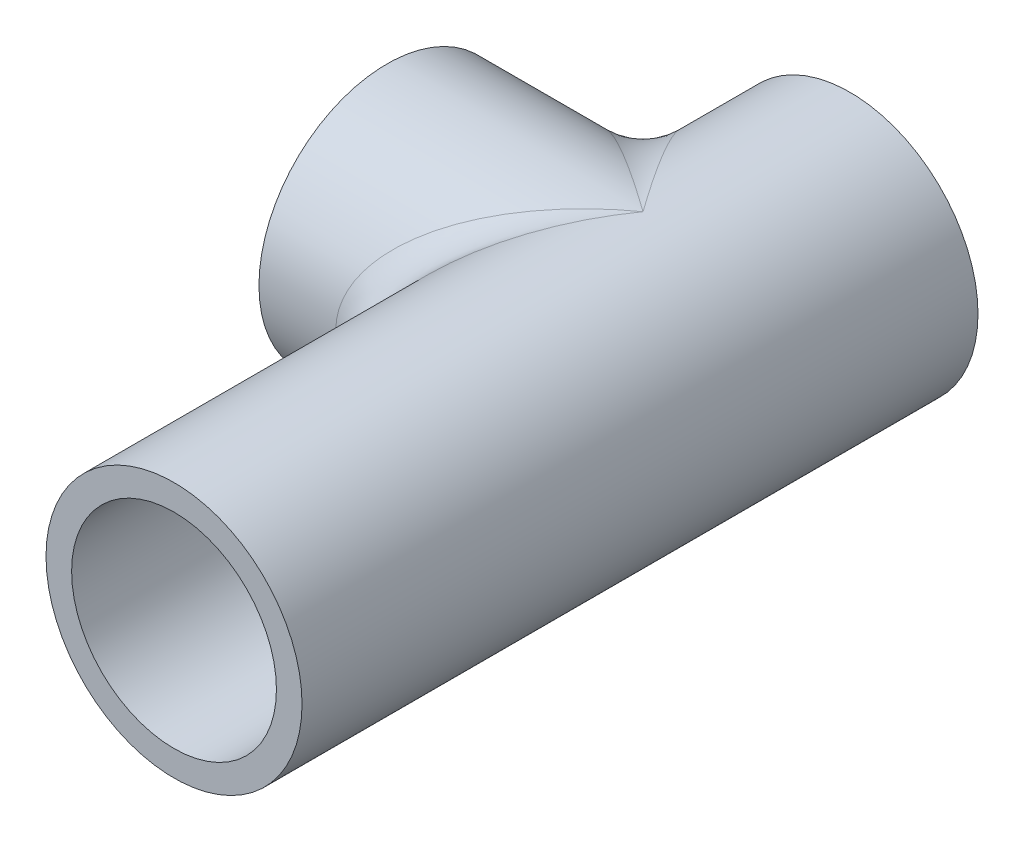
ISO-10303-21;
HEADER;
FILE_DESCRIPTION(('STEP AP214'),'2;1');
FILE_NAME('part.step','',(''),(''),'','','');
FILE_SCHEMA(('AUTOMOTIVE_DESIGN { 1 0 10303 214 1 1 1 1 }'));
ENDSEC;
DATA;
#1=APPLICATION_CONTEXT('core data for automotive mechanical design processes');
#2=APPLICATION_PROTOCOL_DEFINITION('international standard','automotive_design',2000,#1);
#3=PRODUCT_CONTEXT('',#1,'mechanical');
#4=PRODUCT('Part','Part','',(#3));
#5=PRODUCT_RELATED_PRODUCT_CATEGORY('part','',(#4));
#6=PRODUCT_DEFINITION_FORMATION('','',#4);
#7=PRODUCT_DEFINITION_CONTEXT('part definition',#1,'design');
#8=PRODUCT_DEFINITION('design','',#6,#7);
#9=PRODUCT_DEFINITION_SHAPE('','',#8);
#10=(LENGTH_UNIT() NAMED_UNIT(*) SI_UNIT(.MILLI.,.METRE.));
#11=(NAMED_UNIT(*) PLANE_ANGLE_UNIT() SI_UNIT($,.RADIAN.));
#12=(NAMED_UNIT(*) SI_UNIT($,.STERADIAN.) SOLID_ANGLE_UNIT());
#13=UNCERTAINTY_MEASURE_WITH_UNIT(LENGTH_MEASURE(1.E-05),#10,'distance_accuracy_value','');
#14=(GEOMETRIC_REPRESENTATION_CONTEXT(3) GLOBAL_UNCERTAINTY_ASSIGNED_CONTEXT((#13)) GLOBAL_UNIT_ASSIGNED_CONTEXT((#10,
#11,#12)) REPRESENTATION_CONTEXT('',''));
#15=CARTESIAN_POINT('',(0.,0.,0.));
#16=DIRECTION('',(0.,0.,1.));
#17=DIRECTION('',(1.,0.,0.));
#18=AXIS2_PLACEMENT_3D('',#15,#16,#17);
#19=CARTESIAN_POINT('',(0.,0.,-59.8592886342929));
#20=DIRECTION('',(0.,0.,1.));
#21=DIRECTION('',(1.,0.,0.));
#22=AXIS2_PLACEMENT_3D('',#19,#20,#21);
#23=CYLINDRICAL_SURFACE('',#22,25.);
#24=CARTESIAN_POINT('',(0.,0.,-21.4443834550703));
#25=DIRECTION('',(0.813733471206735,0.,-0.581238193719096));
#26=DIRECTION('',(0.581238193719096,0.,0.813733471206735));
#27=AXIS2_PLACEMENT_3D('',#24,#25,#26);
#28=ELLIPSE('',#27,43.0116263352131,25.);
#29=CARTESIAN_POINT('',(0.,-25.,-21.4443834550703));
#30=VERTEX_POINT('',#29);
#31=CARTESIAN_POINT('',(0.,25.,-21.4443834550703));
#32=VERTEX_POINT('',#31);
#33=EDGE_CURVE('E66',#30,#32,#28,.T.);
#34=ORIENTED_EDGE('',*,*,#33,.T.);
#35=CARTESIAN_POINT('',(0.,0.,-21.4443834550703));
#36=DIRECTION('',(-0.813733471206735,0.,-0.581238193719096));
#37=DIRECTION('',(-0.581238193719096,0.,0.813733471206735));
#38=AXIS2_PLACEMENT_3D('',#35,#36,#37);
#39=ELLIPSE('',#38,43.0116263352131,25.);
#40=EDGE_CURVE('E69',#32,#30,#39,.F.);
#41=ORIENTED_EDGE('',*,*,#40,.T.);
#42=EDGE_LOOP('',(#34,#41));
#43=FACE_BOUND('',#42,.T.);
#44=CARTESIAN_POINT('',(0.,0.,70.1407113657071));
#45=DIRECTION('',(0.,0.,1.));
#46=DIRECTION('',(1.,0.,0.));
#47=AXIS2_PLACEMENT_3D('',#44,#45,#46);
#48=CIRCLE('',#47,25.);
#49=CARTESIAN_POINT('',(25.,0.,70.1407113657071));
#50=VERTEX_POINT('',#49);
#51=EDGE_CURVE('E114',#50,#50,#48,.T.);
#52=ORIENTED_EDGE('',*,*,#51,.F.);
#53=EDGE_LOOP('',(#52));
#54=FACE_BOUND('',#53,.T.);
#55=CARTESIAN_POINT('',(0.,0.,-61.8592886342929));
#56=DIRECTION('',(0.,0.,-1.));
#57=DIRECTION('',(-1.,0.,0.));
#58=AXIS2_PLACEMENT_3D('',#55,#56,#57);
#59=CIRCLE('',#58,25.);
#60=CARTESIAN_POINT('',(-25.,0.,-61.8592886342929));
#61=VERTEX_POINT('',#60);
#62=EDGE_CURVE('E128',#61,#61,#59,.T.);
#63=ORIENTED_EDGE('',*,*,#62,.F.);
#64=EDGE_LOOP('',(#63));
#65=FACE_BOUND('',#64,.T.);
#66=ADVANCED_FACE('F42',(#43,#54,#65),#23,.T.);
#67=CARTESIAN_POINT('',(0.,0.,70.1407113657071));
#68=DIRECTION('',(0.,0.,1.));
#69=DIRECTION('',(1.,0.,0.));
#70=AXIS2_PLACEMENT_3D('',#67,#68,#69);
#71=PLANE('',#70);
#72=CARTESIAN_POINT('',(0.,0.,70.1407113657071));
#73=DIRECTION('',(0.,0.,1.));
#74=DIRECTION('',(1.,0.,0.));
#75=AXIS2_PLACEMENT_3D('',#72,#73,#74);
#76=CIRCLE('',#75,20.);
#77=CARTESIAN_POINT('',(20.,0.,70.1407113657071));
#78=VERTEX_POINT('',#77);
#79=EDGE_CURVE('E115',#78,#78,#76,.T.);
#80=ORIENTED_EDGE('',*,*,#79,.F.);
#81=EDGE_LOOP('',(#80));
#82=FACE_BOUND('',#81,.T.);
#83=ORIENTED_EDGE('',*,*,#51,.T.);
#84=EDGE_LOOP('',(#83));
#85=FACE_BOUND('',#84,.T.);
#86=ADVANCED_FACE('F143',(#82,#85),#71,.T.);
#87=CARTESIAN_POINT('',(0.,0.,-59.8592886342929));
#88=DIRECTION('',(0.,0.,1.));
#89=DIRECTION('',(1.,0.,0.));
#90=AXIS2_PLACEMENT_3D('',#87,#88,#89);
#91=CYLINDRICAL_SURFACE('',#90,20.);
#92=CARTESIAN_POINT('',(0.,0.,-59.8592886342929));
#93=DIRECTION('',(0.,0.,1.));
#94=DIRECTION('',(1.,0.,0.));
#95=AXIS2_PLACEMENT_3D('',#92,#93,#94);
#96=CIRCLE('',#95,20.);
#97=CARTESIAN_POINT('',(20.,0.,-59.8592886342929));
#98=VERTEX_POINT('',#97);
#99=EDGE_CURVE('E111',#98,#98,#96,.T.);
#100=ORIENTED_EDGE('',*,*,#99,.F.);
#101=EDGE_LOOP('',(#100));
#102=FACE_BOUND('',#101,.T.);
#103=ORIENTED_EDGE('',*,*,#79,.T.);
#104=EDGE_LOOP('',(#103));
#105=FACE_BOUND('',#104,.T.);
#106=ADVANCED_FACE('F93',(#102,#105),#91,.F.);
#107=CARTESIAN_POINT('',(25.001,0.,-21.4443834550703));
#108=DIRECTION('',(-1.,0.,0.));
#109=DIRECTION('',(0.,0.,1.));
#110=AXIS2_PLACEMENT_3D('',#107,#108,#109);
#111=CYLINDRICAL_SURFACE('',#110,25.);
#112=CARTESIAN_POINT('',(0.,0.,-21.4443834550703));
#113=DIRECTION('',(0.581238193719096,0.,-0.813733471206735));
#114=DIRECTION('',(0.813733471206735,0.,0.581238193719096));
#115=AXIS2_PLACEMENT_3D('',#112,#113,#114);
#116=ELLIPSE('',#115,43.0116263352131,25.);
#117=EDGE_CURVE('E55',#32,#30,#116,.F.);
#118=ORIENTED_EDGE('',*,*,#117,.T.);
#119=CARTESIAN_POINT('',(0.,0.,-21.4443834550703));
#120=DIRECTION('',(-0.581238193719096,0.,-0.813733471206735));
#121=DIRECTION('',(-0.813733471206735,0.,0.581238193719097));
#122=AXIS2_PLACEMENT_3D('',#119,#120,#121);
#123=ELLIPSE('',#122,43.0116263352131,25.);
#124=EDGE_CURVE('E12',#30,#32,#123,.T.);
#125=ORIENTED_EDGE('',*,*,#124,.T.);
#126=EDGE_LOOP('',(#118,#125));
#127=FACE_BOUND('',#126,.T.);
#128=CARTESIAN_POINT('',(-50.,0.,-21.4443834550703));
#129=DIRECTION('',(-1.,0.,0.));
#130=DIRECTION('',(0.,0.,1.));
#131=AXIS2_PLACEMENT_3D('',#128,#129,#130);
#132=CIRCLE('',#131,25.);
#133=CARTESIAN_POINT('',(-50.,0.,3.55561654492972));
#134=VERTEX_POINT('',#133);
#135=EDGE_CURVE('E109',#134,#134,#132,.T.);
#136=ORIENTED_EDGE('',*,*,#135,.F.);
#137=EDGE_LOOP('',(#136));
#138=FACE_BOUND('',#137,.T.);
#139=ADVANCED_FACE('F71',(#127,#138),#111,.T.);
#140=CARTESIAN_POINT('',(-50.,0.,-21.4443834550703));
#141=DIRECTION('',(-1.,0.,0.));
#142=DIRECTION('',(0.,0.,1.));
#143=AXIS2_PLACEMENT_3D('',#140,#141,#142);
#144=PLANE('',#143);
#145=CARTESIAN_POINT('',(-50.,0.,-21.4443834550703));
#146=DIRECTION('',(-1.,0.,0.));
#147=DIRECTION('',(0.,0.,1.));
#148=AXIS2_PLACEMENT_3D('',#145,#146,#147);
#149=CIRCLE('',#148,20.);
#150=CARTESIAN_POINT('',(-50.,0.,-1.44438345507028));
#151=VERTEX_POINT('',#150);
#152=EDGE_CURVE('E108',#151,#151,#149,.T.);
#153=ORIENTED_EDGE('',*,*,#152,.F.);
#154=EDGE_LOOP('',(#153));
#155=FACE_BOUND('',#154,.T.);
#156=ORIENTED_EDGE('',*,*,#135,.T.);
#157=EDGE_LOOP('',(#156));
#158=FACE_BOUND('',#157,.T.);
#159=ADVANCED_FACE('F92',(#155,#158),#144,.T.);
#160=CARTESIAN_POINT('',(25.001,0.,-21.4443834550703));
#161=DIRECTION('',(-1.,0.,0.));
#162=DIRECTION('',(0.,0.,1.));
#163=AXIS2_PLACEMENT_3D('',#160,#161,#162);
#164=CYLINDRICAL_SURFACE('',#163,20.);
#165=CARTESIAN_POINT('',(-25.,0.,-1.44438345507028));
#166=CARTESIAN_POINT('',(-24.9999961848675,-0.480230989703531,-1.44438736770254));
#167=CARTESIAN_POINT('',(-24.9861312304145,-0.960535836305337,-1.46171109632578));
#168=CARTESIAN_POINT('',(-24.9309814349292,-1.91728683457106,-1.53071341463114));
#169=CARTESIAN_POINT('',(-24.8896820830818,-2.3937308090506,-1.58241018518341));
#170=CARTESIAN_POINT('',(-24.7805185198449,-3.33960791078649,-1.71937871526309));
#171=CARTESIAN_POINT('',(-24.712603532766,-3.80902584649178,-1.80471465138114));
#172=CARTESIAN_POINT('',(-24.5517428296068,-4.73639266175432,-2.00751425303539));
#173=CARTESIAN_POINT('',(-24.4587999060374,-5.19434281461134,-2.12497433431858));
#174=CARTESIAN_POINT('',(-24.2504947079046,-6.09302297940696,-2.38938206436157));
#175=CARTESIAN_POINT('',(-24.135279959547,-6.53384455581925,-2.5361358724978));
#176=CARTESIAN_POINT('',(-23.8842407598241,-7.39905284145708,-2.85763977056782));
#177=CARTESIAN_POINT('',(-23.7484161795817,-7.82343944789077,-3.03239003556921));
#178=CARTESIAN_POINT('',(-23.4585340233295,-8.65393451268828,-3.40783578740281));
#179=CARTESIAN_POINT('',(-23.3044810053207,-9.06004750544,-3.60852478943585));
#180=CARTESIAN_POINT('',(-22.9805057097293,-9.85291114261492,-4.03396578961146));
#181=CARTESIAN_POINT('',(-22.8105801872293,-10.239657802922,-4.25872270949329));
#182=CARTESIAN_POINT('',(-22.3957408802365,-11.1240837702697,-4.81267470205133));
#183=CARTESIAN_POINT('',(-22.1453183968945,-11.6134997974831,-5.15098501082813));
#184=CARTESIAN_POINT('',(-21.6258819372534,-12.5542891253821,-5.86431364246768));
#185=CARTESIAN_POINT('',(-21.3568620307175,-13.005650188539,-6.2393436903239));
#186=CARTESIAN_POINT('',(-20.8054114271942,-13.8707836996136,-7.02414171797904));
#187=CARTESIAN_POINT('',(-20.5229470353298,-14.2844532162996,-7.43399924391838));
#188=CARTESIAN_POINT('',(-19.9513787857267,-15.0724701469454,-8.28546420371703));
#189=CARTESIAN_POINT('',(-19.6622756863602,-15.4468220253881,-8.7270680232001));
#190=CARTESIAN_POINT('',(-19.0793974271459,-16.1614492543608,-9.64808490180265));
#191=CARTESIAN_POINT('',(-18.7856199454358,-16.5010997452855,-10.1279814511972));
#192=CARTESIAN_POINT('',(-18.2056451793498,-17.1388512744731,-11.1193045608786));
#193=CARTESIAN_POINT('',(-17.9194503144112,-17.4369391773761,-11.6307410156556));
#194=CARTESIAN_POINT('',(-17.3650266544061,-17.9891202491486,-12.6840032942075));
#195=CARTESIAN_POINT('',(-17.0967504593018,-18.2433325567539,-13.2257413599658));
#196=CARTESIAN_POINT('',(-16.5893497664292,-18.705911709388,-14.3413628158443));
#197=CARTESIAN_POINT('',(-16.350200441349,-18.9143177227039,-14.9152182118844));
#198=CARTESIAN_POINT('',(-16.0082771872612,-19.2031751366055,-15.844012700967));
#199=CARTESIAN_POINT('',(-15.8907318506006,-19.3003699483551,-16.188371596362));
#200=CARTESIAN_POINT('',(-15.6734941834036,-19.4771961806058,-16.8871203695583));
#201=CARTESIAN_POINT('',(-15.573799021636,-19.5568303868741,-17.2415086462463));
#202=CARTESIAN_POINT('',(-15.3958112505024,-19.6972552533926,-17.9585157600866));
#203=CARTESIAN_POINT('',(-15.3174736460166,-19.7580855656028,-18.3211155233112));
#204=CARTESIAN_POINT('',(-15.1850786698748,-19.8600201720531,-19.0535152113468));
#205=CARTESIAN_POINT('',(-15.1310210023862,-19.901124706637,-19.423315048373));
#206=CARTESIAN_POINT('',(-15.0493339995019,-19.962971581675,-20.1709355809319));
#207=CARTESIAN_POINT('',(-15.021945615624,-19.9835283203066,-20.548798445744));
#208=CARTESIAN_POINT('',(-14.9958649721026,-20.0031075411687,-21.3060668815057));
#209=CARTESIAN_POINT('',(-14.9971712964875,-20.002131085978,-21.685472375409));
#210=CARTESIAN_POINT('',(-15.0284195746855,-19.9786629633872,-22.4426924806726));
#211=CARTESIAN_POINT('',(-15.0583823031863,-19.9561556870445,-22.8205057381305));
#212=CARTESIAN_POINT('',(-15.1454268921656,-19.8901730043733,-23.5711299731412));
#213=CARTESIAN_POINT('',(-15.2025125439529,-19.8466946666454,-23.9439402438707));
#214=CARTESIAN_POINT('',(-15.35199595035,-19.7313572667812,-24.7397556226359));
#215=CARTESIAN_POINT('',(-15.4485199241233,-19.656123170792,-25.161492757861));
#216=CARTESIAN_POINT('',(-15.6691696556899,-19.4806804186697,-25.9922971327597));
#217=CARTESIAN_POINT('',(-15.7933013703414,-19.3804663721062,-26.4013616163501));
#218=CARTESIAN_POINT('',(-16.0641576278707,-19.156558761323,-27.2064395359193));
#219=CARTESIAN_POINT('',(-16.210937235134,-19.0328077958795,-27.6024182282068));
#220=CARTESIAN_POINT('',(-16.5218910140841,-18.7635141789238,-28.3797838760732));
#221=CARTESIAN_POINT('',(-16.6860665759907,-18.6179697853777,-28.7611696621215));
#222=CARTESIAN_POINT('',(-17.1112524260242,-18.2297427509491,-29.6931291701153));
#223=CARTESIAN_POINT('',(-17.3802326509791,-17.9744505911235,-30.2348410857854));
#224=CARTESIAN_POINT('',(-17.9351938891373,-17.420755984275,-31.2866752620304));
#225=CARTESIAN_POINT('',(-18.2211827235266,-17.122333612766,-31.796782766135));
#226=CARTESIAN_POINT('',(-18.8010220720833,-16.4835639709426,-32.7863070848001));
#227=CARTESIAN_POINT('',(-19.0948813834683,-16.1431681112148,-33.2656873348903));
#228=CARTESIAN_POINT('',(-19.6822690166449,-15.4215686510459,-34.1927233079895));
#229=CARTESIAN_POINT('',(-19.9757973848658,-15.0403717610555,-34.6403842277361));
#230=CARTESIAN_POINT('',(-20.56353520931,-14.2267204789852,-35.5144340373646));
#231=CARTESIAN_POINT('',(-20.8575522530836,-13.7931665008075,-35.9399317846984));
#232=CARTESIAN_POINT('',(-21.4312715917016,-12.8837032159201,-36.753945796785));
#233=CARTESIAN_POINT('',(-21.7109717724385,-12.4077876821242,-37.1424566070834));
#234=CARTESIAN_POINT('',(-22.2487508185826,-11.4153689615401,-37.878182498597));
#235=CARTESIAN_POINT('',(-22.5068777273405,-10.8989612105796,-38.2254901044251));
#236=CARTESIAN_POINT('',(-22.8731742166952,-10.0947877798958,-38.7126633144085));
#237=CARTESIAN_POINT('',(-22.9917772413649,-9.82183889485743,-38.8694055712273));
#238=CARTESIAN_POINT('',(-23.2212666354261,-9.26623527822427,-39.1711098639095));
#239=CARTESIAN_POINT('',(-23.332151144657,-8.98357823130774,-39.3160690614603));
#240=CARTESIAN_POINT('',(-23.5905697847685,-8.28706523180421,-39.6523759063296));
#241=CARTESIAN_POINT('',(-23.7336902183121,-7.86843138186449,-39.8373070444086));
#242=CARTESIAN_POINT('',(-24.0000570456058,-7.01408763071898,-40.1797594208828));
#243=CARTESIAN_POINT('',(-24.1233083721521,-6.57838200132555,-40.3372874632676));
#244=CARTESIAN_POINT('',(-24.3476687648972,-5.69208561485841,-40.6229336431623));
#245=CARTESIAN_POINT('',(-24.4487888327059,-5.24150238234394,-40.7510663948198));
#246=CARTESIAN_POINT('',(-24.6269331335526,-4.3279026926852,-40.9761670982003));
#247=CARTESIAN_POINT('',(-24.7039567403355,-3.86488591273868,-41.0731342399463));
#248=CARTESIAN_POINT('',(-24.8325753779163,-2.92716764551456,-41.234765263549));
#249=CARTESIAN_POINT('',(-24.8840339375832,-2.45241735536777,-41.2992558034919));
#250=CARTESIAN_POINT('',(-24.9597159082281,-1.49734229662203,-41.3940259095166));
#251=CARTESIAN_POINT('',(-24.9839393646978,-1.01701753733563,-41.4243055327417));
#252=CARTESIAN_POINT('',(-25.0045691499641,-0.0549043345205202,-41.4500960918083));
#253=CARTESIAN_POINT('',(-25.0009794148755,0.426883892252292,-41.4456119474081));
#254=CARTESIAN_POINT('',(-24.9660769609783,1.38785496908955,-41.4019677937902));
#255=CARTESIAN_POINT('',(-24.934765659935,1.86703795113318,-41.3628095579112));
#256=CARTESIAN_POINT('',(-24.8488165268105,2.78015849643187,-41.2551036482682));
#257=CARTESIAN_POINT('',(-24.7962787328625,3.2146111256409,-41.1891999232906));
#258=CARTESIAN_POINT('',(-24.6694630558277,4.07513436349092,-41.0297031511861));
#259=CARTESIAN_POINT('',(-24.5951865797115,4.50120551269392,-40.9361118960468));
#260=CARTESIAN_POINT('',(-24.4262335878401,5.34259277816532,-40.7224839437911));
#261=CARTESIAN_POINT('',(-24.3315530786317,5.75790677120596,-40.6024420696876));
#262=CARTESIAN_POINT('',(-24.12341056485,6.57564496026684,-40.3373892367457));
#263=CARTESIAN_POINT('',(-24.0099475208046,6.97806844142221,-40.1923768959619));
#264=CARTESIAN_POINT('',(-23.7584841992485,7.79276711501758,-39.8692713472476));
#265=CARTESIAN_POINT('',(-23.6194013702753,8.20411611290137,-39.6896883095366));
#266=CARTESIAN_POINT('',(-23.3243132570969,9.00889225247,-39.3060355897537));
#267=CARTESIAN_POINT('',(-23.1683074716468,9.4023188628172,-39.1019651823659));
#268=CARTESIAN_POINT('',(-22.8416894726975,10.1701153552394,-38.6711795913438));
#269=CARTESIAN_POINT('',(-22.6710796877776,10.5444883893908,-38.4444681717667));
#270=CARTESIAN_POINT('',(-22.3175002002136,11.273570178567,-37.9699951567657));
#271=CARTESIAN_POINT('',(-22.1345286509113,11.6282759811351,-37.722230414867));
#272=CARTESIAN_POINT('',(-21.7229363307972,12.3827270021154,-37.1583848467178));
#273=CARTESIAN_POINT('',(-21.4922264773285,12.7783040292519,-36.8382455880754));
#274=CARTESIAN_POINT('',(-21.0203530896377,13.5405215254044,-36.1722646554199));
#275=CARTESIAN_POINT('',(-20.7791883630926,13.9071586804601,-35.8264200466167));
#276=CARTESIAN_POINT('',(-20.2896088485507,14.6122013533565,-35.1095589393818));
#277=CARTESIAN_POINT('',(-20.0411760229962,14.9505268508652,-34.738476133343));
#278=CARTESIAN_POINT('',(-19.5417845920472,15.5976192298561,-33.9729701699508));
#279=CARTESIAN_POINT('',(-19.2908258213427,15.9063841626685,-33.5785454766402));
#280=CARTESIAN_POINT('',(-18.7374522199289,16.5567761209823,-32.6801747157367));
#281=CARTESIAN_POINT('',(-18.4354859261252,16.8913536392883,-32.1708194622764));
#282=CARTESIAN_POINT('',(-17.8435299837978,17.5155207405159,-31.1181189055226));
#283=CARTESIAN_POINT('',(-17.5535467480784,17.8050864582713,-30.5747557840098));
#284=CARTESIAN_POINT('',(-16.9983189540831,18.3358678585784,-29.455522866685));
#285=CARTESIAN_POINT('',(-16.7329908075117,18.5772503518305,-28.8797743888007));
#286=CARTESIAN_POINT('',(-16.2408850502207,19.008964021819,-27.6938926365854));
#287=CARTESIAN_POINT('',(-16.0140600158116,19.1993581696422,-27.0838029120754));
#288=CARTESIAN_POINT('',(-15.7087030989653,19.4487995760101,-26.120439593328));
#289=CARTESIAN_POINT('',(-15.6100539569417,19.5279053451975,-25.7786354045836));
#290=CARTESIAN_POINT('',(-15.4322049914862,19.6687547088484,-25.0864615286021));
#291=CARTESIAN_POINT('',(-15.353001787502,19.7305013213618,-24.7360933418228));
#292=CARTESIAN_POINT('',(-15.2171129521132,19.8354952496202,-24.0290598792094));
#293=CARTESIAN_POINT('',(-15.1603778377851,19.8787832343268,-23.6724102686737));
#294=CARTESIAN_POINT('',(-15.0715849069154,19.9461891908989,-22.9542131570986));
#295=CARTESIAN_POINT('',(-15.0395269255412,19.970307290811,-22.5926656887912));
#296=CARTESIAN_POINT('',(-15.0014910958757,19.9988963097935,-21.8654218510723));
#297=CARTESIAN_POINT('',(-14.9956565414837,20.00325928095,-21.4997136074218));
#298=CARTESIAN_POINT('',(-15.010746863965,19.9919373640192,-20.7691780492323));
#299=CARTESIAN_POINT('',(-15.0316712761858,19.9762528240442,-20.404350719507));
#300=CARTESIAN_POINT('',(-15.0993078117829,19.9251769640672,-19.6780125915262));
#301=CARTESIAN_POINT('',(-15.1460552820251,19.8897586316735,-19.3165070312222));
#302=CARTESIAN_POINT('',(-15.2632476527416,19.7999666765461,-18.5997650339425));
#303=CARTESIAN_POINT('',(-15.3336962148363,19.745590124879,-18.2445295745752));
#304=CARTESIAN_POINT('',(-15.517692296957,19.6014887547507,-17.4458391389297));
#305=CARTESIAN_POINT('',(-15.6377605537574,19.5061601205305,-17.0048963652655));
#306=CARTESIAN_POINT('',(-15.9054632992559,19.2884919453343,-16.1383602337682));
#307=CARTESIAN_POINT('',(-16.0531068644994,19.1661435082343,-15.7127719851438));
#308=CARTESIAN_POINT('',(-16.3701531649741,18.8960714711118,-14.876897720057));
#309=CARTESIAN_POINT('',(-16.5396075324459,18.7482873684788,-14.4666510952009));
#310=CARTESIAN_POINT('',(-16.8945133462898,18.4291192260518,-13.6626971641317));
#311=CARTESIAN_POINT('',(-17.079965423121,18.2577342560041,-13.2689905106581));
#312=CARTESIAN_POINT('',(-17.5489655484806,17.8095827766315,-12.3227748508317));
#313=CARTESIAN_POINT('',(-17.8388318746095,17.5202929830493,-11.7792980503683));
#314=CARTESIAN_POINT('',(-18.4308281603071,16.8964436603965,-10.7259402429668));
#315=CARTESIAN_POINT('',(-18.732963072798,16.5618657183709,-10.2160730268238));
#316=CARTESIAN_POINT('',(-19.3404126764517,15.8482879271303,-9.22952982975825));
#317=CARTESIAN_POINT('',(-19.6457301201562,15.4692461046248,-8.75288589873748));
#318=CARTESIAN_POINT('',(-20.2512609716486,14.6676100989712,-7.83436207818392));
#319=CARTESIAN_POINT('',(-20.5514751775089,14.245022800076,-7.39247671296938));
#320=CARTESIAN_POINT('',(-21.1435580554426,13.3507061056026,-6.53984341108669));
#321=CARTESIAN_POINT('',(-21.4352638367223,12.8784006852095,-6.12958458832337));
#322=CARTESIAN_POINT('',(-21.9989686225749,11.8898743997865,-5.35006661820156));
#323=CARTESIAN_POINT('',(-22.27096435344,11.3736462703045,-4.98081427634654));
#324=CARTESIAN_POINT('',(-22.7873721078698,10.2999855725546,-4.28870687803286));
#325=CARTESIAN_POINT('',(-23.0318492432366,9.74265566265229,-3.96574178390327));
#326=CARTESIAN_POINT('',(-23.4866490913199,8.58844668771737,-3.3706597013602));
#327=CARTESIAN_POINT('',(-23.6969926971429,7.99159213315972,-3.09851159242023));
#328=CARTESIAN_POINT('',(-24.0144793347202,6.96365142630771,-2.69056341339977));
#329=CARTESIAN_POINT('',(-24.1328869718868,6.54211563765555,-2.53926612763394));
#330=CARTESIAN_POINT('',(-24.3490501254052,5.68497622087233,-2.26409380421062));
#331=CARTESIAN_POINT('',(-24.4468071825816,5.24937364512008,-2.14021672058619));
#332=CARTESIAN_POINT('',(-24.6196290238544,4.36753016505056,-1.92181761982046));
#333=CARTESIAN_POINT('',(-24.6947446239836,3.92131554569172,-1.82722985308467));
#334=CARTESIAN_POINT('',(-24.8210480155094,3.02031822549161,-1.66847014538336));
#335=CARTESIAN_POINT('',(-24.8722464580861,2.56553943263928,-1.60428466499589));
#336=CARTESIAN_POINT('',(-24.9405137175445,1.75888736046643,-1.51877924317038));
#337=CARTESIAN_POINT('',(-24.9627918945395,1.40812900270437,-1.49090993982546));
#338=CARTESIAN_POINT('',(-24.9925380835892,0.704927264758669,-1.45370854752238));
#339=CARTESIAN_POINT('',(-25.0000028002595,0.352483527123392,-1.44438058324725));
#340=CARTESIAN_POINT('',(-25.,0.,-1.44438345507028));
#341=B_SPLINE_CURVE_WITH_KNOTS('',3,(#165,#166,#167,#168,#169,#170,#171,#172,#173,#174,#175,
#176,#177,#178,#179,#180,#181,#182,#183,#184,#185,#186,#187,#188,#189,#190,#191,#192,#193,#194,
#195,#196,#197,#198,#199,#200,#201,#202,#203,#204,#205,#206,#207,#208,#209,#210,#211,#212,#213,
#214,#215,#216,#217,#218,#219,#220,#221,#222,#223,#224,#225,#226,#227,#228,#229,#230,#231,#232,
#233,#234,#235,#236,#237,#238,#239,#240,#241,#242,#243,#244,#245,#246,#247,#248,#249,#250,#251,
#252,#253,#254,#255,#256,#257,#258,#259,#260,#261,#262,#263,#264,#265,#266,#267,#268,#269,#270,
#271,#272,#273,#274,#275,#276,#277,#278,#279,#280,#281,#282,#283,#284,#285,#286,#287,#288,#289,
#290,#291,#292,#293,#294,#295,#296,#297,#298,#299,#300,#301,#302,#303,#304,#305,#306,#307,#308,
#309,#310,#311,#312,#313,#314,#315,#316,#317,#318,#319,#320,#321,#322,#323,#324,#325,#326,#327,
#328,#329,#330,#331,#332,#333,#334,#335,#336,#337,#338,#339,#340),.UNSPECIFIED.,.T.,.F.,(4,2,2,
2,2,2,2,2,2,2,2,2,2,2,2,2,2,2,2,2,2,2,2,2,2,2,2,2,2,2,2,2,2,2,2,2,2,2,2,2,2,2,2,2,2,2,2,2,2,2,2,
2,2,2,2,2,2,2,2,2,2,2,2,2,2,2,2,2,2,2,2,2,2,2,2,2,2,2,2,2,2,2,2,2,2,2,2,4),(0.,1.4403137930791,
2.88139001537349,4.32522892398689,5.76890680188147,7.20333074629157,8.63776366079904,
10.0718386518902,11.5062074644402,13.4400199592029,15.3744519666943,17.3140175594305,
19.2533626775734,21.223053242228,23.1933648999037,25.1582392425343,27.1214268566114,
28.250500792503,29.3793954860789,30.5058931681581,31.6323771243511,32.7689467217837,
33.9054602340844,35.0427982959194,36.1802953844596,37.4956824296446,38.8113535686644,
40.130275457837,41.4493028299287,43.4158969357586,45.3834024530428,47.3532073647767,
49.3226888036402,51.3449316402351,53.3674722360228,55.3853814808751,56.3940844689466,
57.4030297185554,58.8400974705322,60.2768078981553,61.712802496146,63.1488344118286,
64.5924519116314,66.0360670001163,67.4794777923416,68.9228147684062,70.24897947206,
71.5750583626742,72.9013970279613,74.2278091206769,75.6361295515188,77.0444917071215,
78.4526201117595,79.8609593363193,81.5356358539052,83.2105038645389,84.8899561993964,
86.5695191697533,88.60752224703,90.646602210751,92.6784955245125,94.7078677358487,
95.8003418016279,96.8926258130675,97.9824906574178,99.0723482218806,100.168153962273,
101.263940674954,102.361231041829,103.458691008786,104.857006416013,106.255782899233,
107.657933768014,109.060139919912,111.098801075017,113.138293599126,115.179727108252,
117.220838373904,119.288945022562,121.357394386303,123.420841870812,125.483021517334,
126.871460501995,128.259795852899,129.644991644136,131.029569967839,132.08650714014,
133.143679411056),.UNSPECIFIED.);
#342=CARTESIAN_POINT('',(-25.,0.,-1.44438345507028));
#343=VERTEX_POINT('',#342);
#344=EDGE_CURVE('E101',#343,#343,#341,.T.);
#345=ORIENTED_EDGE('',*,*,#344,.T.);
#346=EDGE_LOOP('',(#345));
#347=FACE_BOUND('',#346,.T.);
#348=ORIENTED_EDGE('',*,*,#152,.T.);
#349=EDGE_LOOP('',(#348));
#350=FACE_BOUND('',#349,.T.);
#351=ADVANCED_FACE('F94',(#347,#350),#164,.F.);
#352=ORIENTED_EDGE('',*,*,#344,.F.);
#353=EDGE_LOOP('',(#352));
#354=FACE_BOUND('',#353,.T.);
#355=ADVANCED_FACE('F138',(#354),#23,.T.);
#356=CARTESIAN_POINT('',(0.,0.,-59.8592886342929));
#357=DIRECTION('',(0.,0.,-1.));
#358=DIRECTION('',(-1.,0.,0.));
#359=AXIS2_PLACEMENT_3D('',#356,#357,#358);
#360=PLANE('',#359);
#361=ORIENTED_EDGE('',*,*,#99,.T.);
#362=EDGE_LOOP('',(#361));
#363=FACE_BOUND('',#362,.T.);
#364=ADVANCED_FACE('F149',(#363),#360,.F.);
#365=CARTESIAN_POINT('',(0.,0.,-61.8592886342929));
#366=DIRECTION('',(0.,0.,-1.));
#367=DIRECTION('',(-1.,0.,0.));
#368=AXIS2_PLACEMENT_3D('',#365,#366,#367);
#369=PLANE('',#368);
#370=CARTESIAN_POINT('',(0.,0.,-61.8592886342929));
#371=DIRECTION('',(0.,0.,-1.));
#372=DIRECTION('',(-1.,0.,0.));
#373=AXIS2_PLACEMENT_3D('',#370,#371,#372);
#374=CIRCLE('',#373,15.);
#375=CARTESIAN_POINT('',(-15.,0.,-61.8592886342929));
#376=VERTEX_POINT('',#375);
#377=EDGE_CURVE('E119',#376,#376,#374,.T.);
#378=ORIENTED_EDGE('',*,*,#377,.F.);
#379=EDGE_LOOP('',(#378));
#380=FACE_BOUND('',#379,.T.);
#381=ORIENTED_EDGE('',*,*,#62,.T.);
#382=EDGE_LOOP('',(#381));
#383=FACE_BOUND('',#382,.T.);
#384=ADVANCED_FACE('F154',(#380,#383),#369,.T.);
#385=CARTESIAN_POINT('',(0.,0.,-62.8592886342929));
#386=DIRECTION('',(0.,0.,-1.));
#387=DIRECTION('',(-1.,0.,0.));
#388=AXIS2_PLACEMENT_3D('',#385,#386,#387);
#389=PLANE('',#388);
#390=CARTESIAN_POINT('',(0.,0.,-62.8592886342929));
#391=DIRECTION('',(0.,0.,-1.));
#392=DIRECTION('',(-1.,0.,0.));
#393=AXIS2_PLACEMENT_3D('',#390,#391,#392);
#394=CIRCLE('',#393,14.);
#395=CARTESIAN_POINT('',(-14.,0.,-62.8592886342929));
#396=VERTEX_POINT('',#395);
#397=EDGE_CURVE('E75',#396,#396,#394,.T.);
#398=ORIENTED_EDGE('',*,*,#397,.T.);
#399=EDGE_LOOP('',(#398));
#400=FACE_BOUND('',#399,.T.);
#401=ADVANCED_FACE('F162',(#400),#389,.T.);
#402=CARTESIAN_POINT('',(0.,0.,-61.8592886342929));
#403=DIRECTION('',(0.,0.,-1.));
#404=DIRECTION('',(-1.,0.,0.));
#405=AXIS2_PLACEMENT_3D('',#402,#403,#404);
#406=TOROIDAL_SURFACE('',#405,14.,1.);
#407=ORIENTED_EDGE('',*,*,#377,.T.);
#408=EDGE_LOOP('',(#407));
#409=FACE_BOUND('',#408,.T.);
#410=ORIENTED_EDGE('',*,*,#397,.F.);
#411=EDGE_LOOP('',(#410));
#412=FACE_BOUND('',#411,.T.);
#413=ADVANCED_FACE('F85',(#409,#412),#406,.T.);
#414=CARTESIAN_POINT('',(0.,25.,-21.4443834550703));
#415=CARTESIAN_POINT('',(0.,25.,-21.4443834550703));
#416=CARTESIAN_POINT('',(0.,25.,-21.4443834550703));
#417=CARTESIAN_POINT('',(-0.544616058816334,24.9999712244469,-20.6819209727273));
#418=CARTESIAN_POINT('',(-0.653544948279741,25.0001048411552,-20.7908385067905));
#419=CARTESIAN_POINT('',(-0.762462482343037,24.9999712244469,-20.899767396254));
#420=CARTESIAN_POINT('',(-1.08923208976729,24.9822019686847,-19.9194585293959));
#421=CARTESIAN_POINT('',(-1.30754456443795,24.9750777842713,-20.1368388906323));
#422=CARTESIAN_POINT('',(-1.52492492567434,24.9822019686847,-20.355151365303));
#423=CARTESIAN_POINT('',(-2.17734024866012,24.9109789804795,-18.3961071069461));
#424=CARTESIAN_POINT('',(-2.61187427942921,24.8753502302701,-18.8325091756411));
#425=CARTESIAN_POINT('',(-3.04827634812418,24.9109789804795,-19.2670432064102));
#426=CARTESIAN_POINT('',(-2.720832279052,24.8575222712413,-17.6352182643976));
#427=CARTESIAN_POINT('',(-3.26312878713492,24.8005035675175,-18.1812546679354));
#428=CARTESIAN_POINT('',(-3.80916519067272,24.8575222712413,-18.7235511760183));
#429=CARTESIAN_POINT('',(-3.80085624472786,24.7153291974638,-16.1231847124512));
#430=CARTESIAN_POINT('',(-4.55354174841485,24.6019421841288,-16.8908417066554));
#431=CARTESIAN_POINT('',(-5.32119874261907,24.7153291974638,-17.6435272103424));
#432=CARTESIAN_POINT('',(-4.33740802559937,24.626897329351,-15.3720122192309));
#433=CARTESIAN_POINT('',(-5.19365954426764,24.4783681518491,-16.2507239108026));
#434=CARTESIAN_POINT('',(-6.07237123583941,24.626897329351,-17.1069754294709));
#435=CARTESIAN_POINT('',(-5.40689184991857,24.4143977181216,-13.874734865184));
#436=CARTESIAN_POINT('',(-6.46447435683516,24.1825641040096,-14.9799090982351));
#437=CARTESIAN_POINT('',(-7.56964858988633,24.4143977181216,-16.0374916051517));
#438=CARTESIAN_POINT('',(-5.93982397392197,24.2903307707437,-13.1286298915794));
#439=CARTESIAN_POINT('',(-7.09602334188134,24.0099198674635,-14.3483601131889));
#440=CARTESIAN_POINT('',(-8.31575356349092,24.2903307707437,-15.5045594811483));
#441=CARTESIAN_POINT('',(-7.51370047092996,23.868619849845,-10.9252027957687));
#442=CARTESIAN_POINT('',(-8.95627397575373,23.4238114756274,-12.4881094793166));
#443=CARTESIAN_POINT('',(-10.5191806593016,23.868619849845,-13.9306829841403));
#444=CARTESIAN_POINT('',(-8.54811301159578,23.5190695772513,-9.47702523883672));
#445=CARTESIAN_POINT('',(-10.1671624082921,22.9386642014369,-11.2772210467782));
#446=CARTESIAN_POINT('',(-11.9673582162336,23.5190695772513,-12.8962704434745));
#447=CARTESIAN_POINT('',(-10.0641831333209,22.8910795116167,-7.35452706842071));
#448=CARTESIAN_POINT('',(-11.9034059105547,22.0846786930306,-9.5409775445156));
#449=CARTESIAN_POINT('',(-14.0898563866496,22.8910795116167,-11.3802003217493));
#450=CARTESIAN_POINT('',(-10.5576059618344,22.6679091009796,-6.66373510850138));
#451=CARTESIAN_POINT('',(-12.4667727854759,21.78066204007,-8.97761066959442));
#452=CARTESIAN_POINT('',(-14.7806483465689,22.6679091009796,-10.8867774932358));
#453=CARTESIAN_POINT('',(-11.5357127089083,22.1861349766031,-5.29438566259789));
#454=CARTESIAN_POINT('',(-13.572475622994,21.1292625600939,-7.87190783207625));
#455=CARTESIAN_POINT('',(-16.1499977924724,22.1861349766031,-9.908670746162));
#456=CARTESIAN_POINT('',(-12.0203965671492,21.9275310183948,-4.61582826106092));
#457=CARTESIAN_POINT('',(-14.115298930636,20.7810528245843,-7.32908452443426));
#458=CARTESIAN_POINT('',(-16.8285551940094,21.9275310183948,-9.42398688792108));
#459=CARTESIAN_POINT('',(-13.4283665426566,21.1146487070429,-2.64467029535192));
#460=CARTESIAN_POINT('',(-15.6806599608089,19.6903261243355,-5.76372349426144));
#461=CARTESIAN_POINT('',(-18.7997131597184,21.1146487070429,-8.01601691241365));
#462=CARTESIAN_POINT('',(-14.3376971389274,20.5101237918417,-1.37160746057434));
#463=CARTESIAN_POINT('',(-16.6633410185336,18.8893084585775,-4.78104243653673));
#464=CARTESIAN_POINT('',(-20.0727759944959,20.5101237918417,-7.10668631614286));
#465=CARTESIAN_POINT('',(-15.6431368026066,19.5084018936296,0.456008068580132));
#466=CARTESIAN_POINT('',(-18.0156909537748,17.6075509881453,-3.42869250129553));
#467=CARTESIAN_POINT('',(-21.9003915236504,19.5084018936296,-5.80124665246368));
#468=CARTESIAN_POINT('',(-16.0607562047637,19.1663526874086,1.04067523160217));
#469=CARTESIAN_POINT('',(-18.4434083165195,17.1708033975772,-3.00097513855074));
#470=CARTESIAN_POINT('',(-22.4850586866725,19.1663526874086,-5.38362725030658));
#471=CARTESIAN_POINT('',(-16.880996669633,18.4480184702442,2.18901188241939));
#472=CARTESIAN_POINT('',(-19.2661412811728,16.2667807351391,-2.17824217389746));
#473=CARTESIAN_POINT('',(-23.6333953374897,18.4480184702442,-4.56338678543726));
#474=CARTESIAN_POINT('',(-17.2836169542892,18.0717316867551,2.75268028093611));
#475=CARTESIAN_POINT('',(-19.6610346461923,15.7987060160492,-1.78334880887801));
#476=CARTESIAN_POINT('',(-24.1970637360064,18.0717316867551,-4.16076650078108));
#477=CARTESIAN_POINT('',(-18.4318504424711,16.9234702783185,4.36020716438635));
#478=CARTESIAN_POINT('',(-20.7655487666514,14.3855856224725,-0.678834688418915));
#479=CARTESIAN_POINT('',(-25.8045906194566,16.9234702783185,-3.01253301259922));
#480=CARTESIAN_POINT('',(-19.1546474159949,16.1041589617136,5.37212292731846));
#481=CARTESIAN_POINT('',(-21.4170104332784,13.4098715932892,-0.0273730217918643));
#482=CARTESIAN_POINT('',(-26.8165063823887,16.1041589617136,-2.28973603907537));
#483=CARTESIAN_POINT('',(-20.1583553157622,14.796115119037,6.77731398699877));
#484=CARTESIAN_POINT('',(-22.2537533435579,11.941094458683,0.809369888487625));
#485=CARTESIAN_POINT('',(-28.2216974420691,14.796115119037,-1.28602813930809));
#486=CARTESIAN_POINT('',(-20.4729206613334,14.3581695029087,7.21770547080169));
#487=CARTESIAN_POINT('',(-22.5073146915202,11.4558871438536,1.06293123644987));
#488=CARTESIAN_POINT('',(-28.662088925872,14.3581695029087,-0.971462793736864));
#489=CARTESIAN_POINT('',(-21.0795191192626,13.4518061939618,8.06694331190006));
#490=CARTESIAN_POINT('',(-22.9757180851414,10.4790368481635,1.53133463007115));
#491=CARTESIAN_POINT('',(-29.5113267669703,13.4518061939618,-0.364864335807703));
#492=CARTESIAN_POINT('',(-21.3715508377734,12.9833866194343,8.47578771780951));
#493=CARTESIAN_POINT('',(-23.1899245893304,9.98735002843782,1.74554113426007));
#494=CARTESIAN_POINT('',(-29.9201711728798,12.9833866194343,-0.0728326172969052));
#495=CARTESIAN_POINT('',(-21.9174779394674,12.0378160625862,9.24008566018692));
#496=CARTESIAN_POINT('',(-23.569801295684,9.02692430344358,2.12541784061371));
#497=CARTESIAN_POINT('',(-30.6844691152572,12.0378160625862,0.473094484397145));
#498=CARTESIAN_POINT('',(-22.1724842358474,11.5619492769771,9.59709447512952));
#499=CARTESIAN_POINT('',(-23.7366679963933,8.55803945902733,2.29228454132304));
#500=CARTESIAN_POINT('',(-31.0414779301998,11.5619492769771,0.728100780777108));
#501=CARTESIAN_POINT('',(-22.6556493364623,10.5838954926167,10.2735256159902));
#502=CARTESIAN_POINT('',(-24.0343866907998,7.62830695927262,2.59000323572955));
#503=CARTESIAN_POINT('',(-31.7179090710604,10.5838954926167,1.21126588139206));
#504=CARTESIAN_POINT('',(-22.8838200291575,10.0817202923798,10.5929645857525));
#505=CARTESIAN_POINT('',(-24.1646045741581,7.16795262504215,2.72022111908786));
#506=CARTESIAN_POINT('',(-32.0373480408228,10.0817202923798,1.43943657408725));
#507=CARTESIAN_POINT('',(-23.3018414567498,9.07252587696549,11.1781945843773));
#508=CARTESIAN_POINT('',(-24.3867687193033,6.27959138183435,2.94238526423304));
#509=CARTESIAN_POINT('',(-32.6225780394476,9.07252587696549,1.85745800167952));
#510=CARTESIAN_POINT('',(-23.4928397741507,8.56645971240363,11.4455922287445));
#511=CARTESIAN_POINT('',(-24.4795087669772,5.85150344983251,3.03512531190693));
#512=CARTESIAN_POINT('',(-32.8899756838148,8.56645971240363,2.04845631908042));
#513=CARTESIAN_POINT('',(-23.844185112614,7.53341838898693,11.937475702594));
#514=CARTESIAN_POINT('',(-24.6372458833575,5.01333848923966,3.19286242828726));
#515=CARTESIAN_POINT('',(-33.3818591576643,7.53341838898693,2.39980165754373));
#516=CARTESIAN_POINT('',(-24.0045338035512,7.00644437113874,12.161963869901));
#517=CARTESIAN_POINT('',(-24.7017773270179,4.60416444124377,3.25739387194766));
#518=CARTESIAN_POINT('',(-33.6063473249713,7.00644437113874,2.56015034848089));
#519=CARTESIAN_POINT('',(-24.2874681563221,5.95051601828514,12.558071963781));
#520=CARTESIAN_POINT('',(-24.8063142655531,3.81826062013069,3.36193081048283));
#521=CARTESIAN_POINT('',(-34.0024554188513,5.95051601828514,2.84308470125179));
#522=CARTESIAN_POINT('',(-24.4110386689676,5.4220909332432,12.7310706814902));
#523=CARTESIAN_POINT('',(-24.8466837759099,3.44178305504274,3.40230032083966));
#524=CARTESIAN_POINT('',(-34.1754541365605,5.4220909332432,2.96665521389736));
#525=CARTESIAN_POINT('',(-24.6243815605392,4.35172934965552,13.0297507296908));
#526=CARTESIAN_POINT('',(-24.9108884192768,2.70732678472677,3.46650496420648));
#527=CARTESIAN_POINT('',(-34.4741341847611,4.35172934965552,3.17999810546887));
#528=CARTESIAN_POINT('',(-24.7141554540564,3.80979345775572,13.1554341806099));
#529=CARTESIAN_POINT('',(-24.9345139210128,2.35036798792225,3.49013046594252));
#530=CARTESIAN_POINT('',(-34.5998176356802,3.80979345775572,3.26977199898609));
#531=CARTESIAN_POINT('',(-24.85691392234,2.72543126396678,13.3552960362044));
#532=CARTESIAN_POINT('',(-24.9697052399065,1.65665186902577,3.52532178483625));
#533=CARTESIAN_POINT('',(-34.7996794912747,2.72543126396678,3.41253046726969));
#534=CARTESIAN_POINT('',(-24.9104746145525,2.18315710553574,13.4302810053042));
#535=CARTESIAN_POINT('',(-24.9813532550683,1.32061318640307,3.53696979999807));
#536=CARTESIAN_POINT('',(-34.8746644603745,2.18315710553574,3.46609115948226));
#537=CARTESIAN_POINT('',(-24.9820173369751,1.09392190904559,13.5304408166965));
#538=CARTESIAN_POINT('',(-24.9965228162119,0.655902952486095,3.55213936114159));
#539=CARTESIAN_POINT('',(-34.9748242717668,1.09392190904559,3.53763388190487));
#540=CARTESIAN_POINT('',(-25.,0.546960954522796,13.5556165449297));
#541=CARTESIAN_POINT('',(-25.,0.328187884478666,3.55561654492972));
#542=CARTESIAN_POINT('',(-35.,0.546960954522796,3.55561654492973));
#543=CARTESIAN_POINT('',(-25.,-0.546960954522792,13.5556165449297));
#544=CARTESIAN_POINT('',(-25.,-0.328187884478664,3.55561654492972));
#545=CARTESIAN_POINT('',(-35.,-0.546960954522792,3.55561654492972));
#546=CARTESIAN_POINT('',(-24.9820173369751,-1.09392190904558,13.5304408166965));
#547=CARTESIAN_POINT('',(-24.9965228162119,-0.65590295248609,3.5521393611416));
#548=CARTESIAN_POINT('',(-34.9748242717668,-1.09392190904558,3.53763388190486));
#549=CARTESIAN_POINT('',(-24.9104746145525,-2.18315710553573,13.4302810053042));
#550=CARTESIAN_POINT('',(-24.9813532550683,-1.32061318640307,3.53696979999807));
#551=CARTESIAN_POINT('',(-34.8746644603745,-2.18315710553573,3.46609115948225));
#552=CARTESIAN_POINT('',(-24.85691392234,-2.72543126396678,13.3552960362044));
#553=CARTESIAN_POINT('',(-24.9697052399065,-1.65665186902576,3.52532178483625));
#554=CARTESIAN_POINT('',(-34.7996794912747,-2.72543126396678,3.4125304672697));
#555=CARTESIAN_POINT('',(-24.7141554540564,-3.80979345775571,13.1554341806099));
#556=CARTESIAN_POINT('',(-24.9345139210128,-2.35036798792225,3.49013046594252));
#557=CARTESIAN_POINT('',(-34.5998176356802,-3.80979345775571,3.26977199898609));
#558=CARTESIAN_POINT('',(-24.6243815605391,-4.35172934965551,13.0297507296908));
#559=CARTESIAN_POINT('',(-24.9108884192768,-2.70732678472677,3.46650496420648));
#560=CARTESIAN_POINT('',(-34.474134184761,-4.35172934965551,3.17999810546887));
#561=CARTESIAN_POINT('',(-24.4110386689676,-5.42209093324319,12.7310706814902));
#562=CARTESIAN_POINT('',(-24.8466837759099,-3.44178305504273,3.40230032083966));
#563=CARTESIAN_POINT('',(-34.1754541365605,-5.42209093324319,2.96665521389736));
#564=CARTESIAN_POINT('',(-24.2874681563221,-5.95051601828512,12.558071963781));
#565=CARTESIAN_POINT('',(-24.8063142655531,-3.81826062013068,3.36193081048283));
#566=CARTESIAN_POINT('',(-34.0024554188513,-5.95051601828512,2.84308470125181));
#567=CARTESIAN_POINT('',(-24.0045338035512,-7.00644437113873,12.161963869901));
#568=CARTESIAN_POINT('',(-24.7017773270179,-4.60416444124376,3.25739387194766));
#569=CARTESIAN_POINT('',(-33.6063473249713,-7.00644437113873,2.56015034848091));
#570=CARTESIAN_POINT('',(-23.844185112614,-7.53341838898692,11.937475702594));
#571=CARTESIAN_POINT('',(-24.6372458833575,-5.01333848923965,3.19286242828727));
#572=CARTESIAN_POINT('',(-33.3818591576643,-7.53341838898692,2.39980165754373));
#573=CARTESIAN_POINT('',(-23.4928397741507,-8.56645971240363,11.4455922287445));
#574=CARTESIAN_POINT('',(-24.4795087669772,-5.8515034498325,3.03512531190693));
#575=CARTESIAN_POINT('',(-32.8899756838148,-8.56645971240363,2.04845631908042));
#576=CARTESIAN_POINT('',(-23.3018414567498,-9.07252587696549,11.1781945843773));
#577=CARTESIAN_POINT('',(-24.3867687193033,-6.27959138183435,2.94238526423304));
#578=CARTESIAN_POINT('',(-32.6225780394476,-9.07252587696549,1.85745800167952));
#579=CARTESIAN_POINT('',(-22.8838200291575,-10.0817202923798,10.5929645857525));
#580=CARTESIAN_POINT('',(-24.1646045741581,-7.16795262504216,2.72022111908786));
#581=CARTESIAN_POINT('',(-32.0373480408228,-10.0817202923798,1.43943657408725));
#582=CARTESIAN_POINT('',(-22.6556493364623,-10.5838954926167,10.2735256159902));
#583=CARTESIAN_POINT('',(-24.0343866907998,-7.62830695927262,2.59000323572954));
#584=CARTESIAN_POINT('',(-31.7179090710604,-10.5838954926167,1.21126588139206));
#585=CARTESIAN_POINT('',(-22.1724842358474,-11.5619492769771,9.59709447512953));
#586=CARTESIAN_POINT('',(-23.7366679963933,-8.55803945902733,2.29228454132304));
#587=CARTESIAN_POINT('',(-31.0414779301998,-11.5619492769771,0.728100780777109));
#588=CARTESIAN_POINT('',(-21.9174779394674,-12.0378160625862,9.24008566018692));
#589=CARTESIAN_POINT('',(-23.569801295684,-9.02692430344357,2.12541784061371));
#590=CARTESIAN_POINT('',(-30.6844691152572,-12.0378160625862,0.473094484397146));
#591=CARTESIAN_POINT('',(-21.3715508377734,-12.9833866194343,8.47578771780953));
#592=CARTESIAN_POINT('',(-23.1899245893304,-9.98735002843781,1.74554113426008));
#593=CARTESIAN_POINT('',(-29.9201711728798,-12.9833866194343,-0.0728326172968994));
#594=CARTESIAN_POINT('',(-21.0795191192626,-13.4518061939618,8.06694331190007));
#595=CARTESIAN_POINT('',(-22.9757180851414,-10.4790368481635,1.53133463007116));
#596=CARTESIAN_POINT('',(-29.5113267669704,-13.4518061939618,-0.364864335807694));
#597=CARTESIAN_POINT('',(-20.4729206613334,-14.3581695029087,7.2177054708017));
#598=CARTESIAN_POINT('',(-22.5073146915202,-11.4558871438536,1.06293123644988));
#599=CARTESIAN_POINT('',(-28.662088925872,-14.3581695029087,-0.971462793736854));
#600=CARTESIAN_POINT('',(-20.1583553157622,-14.796115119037,6.77731398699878));
#601=CARTESIAN_POINT('',(-22.2537533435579,-11.941094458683,0.809369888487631));
#602=CARTESIAN_POINT('',(-28.2216974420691,-14.796115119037,-1.28602813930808));
#603=CARTESIAN_POINT('',(-19.1546474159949,-16.1041589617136,5.37212292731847));
#604=CARTESIAN_POINT('',(-21.4170104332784,-13.4098715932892,-0.0273730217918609));
#605=CARTESIAN_POINT('',(-26.8165063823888,-16.1041589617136,-2.28973603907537));
#606=CARTESIAN_POINT('',(-18.4318504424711,-16.9234702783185,4.36020716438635));
#607=CARTESIAN_POINT('',(-20.7655487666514,-14.3855856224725,-0.678834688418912));
#608=CARTESIAN_POINT('',(-25.8045906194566,-16.9234702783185,-3.01253301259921));
#609=CARTESIAN_POINT('',(-17.2836169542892,-18.0717316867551,2.75268028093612));
#610=CARTESIAN_POINT('',(-19.6610346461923,-15.7987060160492,-1.783348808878));
#611=CARTESIAN_POINT('',(-24.1970637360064,-18.0717316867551,-4.16076650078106));
#612=CARTESIAN_POINT('',(-16.880996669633,-18.4480184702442,2.1890118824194));
#613=CARTESIAN_POINT('',(-19.2661412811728,-16.2667807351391,-2.17824217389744));
#614=CARTESIAN_POINT('',(-23.6333953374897,-18.4480184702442,-4.56338678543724));
#615=CARTESIAN_POINT('',(-16.0607562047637,-19.1663526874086,1.04067523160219));
#616=CARTESIAN_POINT('',(-18.4434083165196,-17.1708033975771,-3.00097513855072));
#617=CARTESIAN_POINT('',(-22.4850586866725,-19.1663526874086,-5.38362725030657));
#618=CARTESIAN_POINT('',(-15.6431368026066,-19.5084018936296,0.456008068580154));
#619=CARTESIAN_POINT('',(-18.0156909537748,-17.6075509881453,-3.42869250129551));
#620=CARTESIAN_POINT('',(-21.9003915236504,-19.5084018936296,-5.80124665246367));
#621=CARTESIAN_POINT('',(-14.3376971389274,-20.5101237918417,-1.37160746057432));
#622=CARTESIAN_POINT('',(-16.6633410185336,-18.8893084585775,-4.78104243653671));
#623=CARTESIAN_POINT('',(-20.072775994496,-20.5101237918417,-7.10668631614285));
#624=CARTESIAN_POINT('',(-13.4283665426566,-21.1146487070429,-2.64467029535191));
#625=CARTESIAN_POINT('',(-15.6806599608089,-19.6903261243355,-5.76372349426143));
#626=CARTESIAN_POINT('',(-18.7997131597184,-21.1146487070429,-8.01601691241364));
#627=CARTESIAN_POINT('',(-12.0203965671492,-21.9275310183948,-4.61582826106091));
#628=CARTESIAN_POINT('',(-14.115298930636,-20.7810528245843,-7.32908452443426));
#629=CARTESIAN_POINT('',(-16.8285551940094,-21.9275310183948,-9.42398688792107));
#630=CARTESIAN_POINT('',(-11.5357127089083,-22.1861349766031,-5.29438566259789));
#631=CARTESIAN_POINT('',(-13.572475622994,-21.1292625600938,-7.87190783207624));
#632=CARTESIAN_POINT('',(-16.1499977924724,-22.1861349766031,-9.908670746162));
#633=CARTESIAN_POINT('',(-10.5576059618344,-22.6679091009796,-6.66373510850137));
#634=CARTESIAN_POINT('',(-12.4667727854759,-21.78066204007,-8.97761066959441));
#635=CARTESIAN_POINT('',(-14.7806483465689,-22.6679091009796,-10.8867774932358));
#636=CARTESIAN_POINT('',(-10.064183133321,-22.8910795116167,-7.35452706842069));
#637=CARTESIAN_POINT('',(-11.9034059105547,-22.0846786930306,-9.54097754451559));
#638=CARTESIAN_POINT('',(-14.0898563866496,-22.8910795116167,-11.3802003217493));
#639=CARTESIAN_POINT('',(-8.5481130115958,-23.5190695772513,-9.4770252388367));
#640=CARTESIAN_POINT('',(-10.1671624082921,-22.9386642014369,-11.2772210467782));
#641=CARTESIAN_POINT('',(-11.9673582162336,-23.5190695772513,-12.8962704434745));
#642=CARTESIAN_POINT('',(-7.51370047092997,-23.868619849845,-10.9252027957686));
#643=CARTESIAN_POINT('',(-8.95627397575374,-23.4238114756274,-12.4881094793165));
#644=CARTESIAN_POINT('',(-10.5191806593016,-23.868619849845,-13.9306829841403));
#645=CARTESIAN_POINT('',(-5.93982397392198,-24.2903307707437,-13.1286298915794));
#646=CARTESIAN_POINT('',(-7.09602334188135,-24.0099198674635,-14.3483601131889));
#647=CARTESIAN_POINT('',(-8.31575356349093,-24.2903307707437,-15.5045594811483));
#648=CARTESIAN_POINT('',(-5.40689184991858,-24.4143977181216,-13.8747348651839));
#649=CARTESIAN_POINT('',(-6.46447435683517,-24.1825641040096,-14.9799090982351));
#650=CARTESIAN_POINT('',(-7.56964858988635,-24.4143977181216,-16.0374916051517));
#651=CARTESIAN_POINT('',(-4.33740802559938,-24.626897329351,-15.3720122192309));
#652=CARTESIAN_POINT('',(-5.19365954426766,-24.4783681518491,-16.2507239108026));
#653=CARTESIAN_POINT('',(-6.07237123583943,-24.626897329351,-17.1069754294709));
#654=CARTESIAN_POINT('',(-3.80085624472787,-24.7153291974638,-16.1231847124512));
#655=CARTESIAN_POINT('',(-4.55354174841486,-24.6019421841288,-16.8908417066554));
#656=CARTESIAN_POINT('',(-5.32119874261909,-24.7153291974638,-17.6435272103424));
#657=CARTESIAN_POINT('',(-2.72083227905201,-24.8575222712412,-17.6352182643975));
#658=CARTESIAN_POINT('',(-3.26312878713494,-24.8005035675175,-18.1812546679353));
#659=CARTESIAN_POINT('',(-3.80916519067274,-24.8575222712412,-18.7235511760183));
#660=CARTESIAN_POINT('',(-2.17734024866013,-24.9109789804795,-18.3961071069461));
#661=CARTESIAN_POINT('',(-2.61187427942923,-24.8753502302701,-18.8325091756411));
#662=CARTESIAN_POINT('',(-3.04827634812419,-24.9109789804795,-19.2670432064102));
#663=CARTESIAN_POINT('',(-1.0892320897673,-24.9822019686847,-19.9194585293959));
#664=CARTESIAN_POINT('',(-1.30754456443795,-24.9750777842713,-20.1368388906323));
#665=CARTESIAN_POINT('',(-1.52492492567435,-24.9822019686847,-20.355151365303));
#666=CARTESIAN_POINT('',(-0.544616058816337,-24.9999712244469,-20.6819209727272));
#667=CARTESIAN_POINT('',(-0.653544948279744,-25.0001048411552,-20.7908385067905));
#668=CARTESIAN_POINT('',(-0.762462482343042,-24.9999712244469,-20.8997673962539));
#669=CARTESIAN_POINT('',(0.,-25.,-21.4443834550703));
#670=CARTESIAN_POINT('',(0.,-25.,-21.4443834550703));
#671=CARTESIAN_POINT('',(0.,-25.,-21.4443834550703));
#672=(BOUNDED_SURFACE() B_SPLINE_SURFACE(3,2,((#414,#415,#416),(#417,#418,#419),(#420,#421,
#422),(#423,#424,#425),(#426,#427,#428),(#429,#430,#431),(#432,#433,#434),(#435,#436,#437),
(#438,#439,#440),(#441,#442,#443),(#444,#445,#446),(#447,#448,#449),(#450,#451,#452),(#453,#454,
#455),(#456,#457,#458),(#459,#460,#461),(#462,#463,#464),(#465,#466,#467),(#468,#469,#470),
(#471,#472,#473),(#474,#475,#476),(#477,#478,#479),(#480,#481,#482),(#483,#484,#485),(#486,#487,
#488),(#489,#490,#491),(#492,#493,#494),(#495,#496,#497),(#498,#499,#500),(#501,#502,#503),
(#504,#505,#506),(#507,#508,#509),(#510,#511,#512),(#513,#514,#515),(#516,#517,#518),(#519,#520,
#521),(#522,#523,#524),(#525,#526,#527),(#528,#529,#530),(#531,#532,#533),(#534,#535,#536),
(#537,#538,#539),(#540,#541,#542),(#543,#544,#545),(#546,#547,#548),(#549,#550,#551),(#552,#553,
#554),(#555,#556,#557),(#558,#559,#560),(#561,#562,#563),(#564,#565,#566),(#567,#568,#569),
(#570,#571,#572),(#573,#574,#575),(#576,#577,#578),(#579,#580,#581),(#582,#583,#584),(#585,#586,
#587),(#588,#589,#590),(#591,#592,#593),(#594,#595,#596),(#597,#598,#599),(#600,#601,#602),
(#603,#604,#605),(#606,#607,#608),(#609,#610,#611),(#612,#613,#614),(#615,#616,#617),(#618,#619,
#620),(#621,#622,#623),(#624,#625,#626),(#627,#628,#629),(#630,#631,#632),(#633,#634,#635),
(#636,#637,#638),(#639,#640,#641),(#642,#643,#644),(#645,#646,#647),(#648,#649,#650),(#651,#652,
#653),(#654,#655,#656),(#657,#658,#659),(#660,#661,#662),(#663,#664,#665),(#666,#667,#668),
(#669,#670,#671)),.UNSPECIFIED.,.F.,.F.,.F.) B_SPLINE_SURFACE_WITH_KNOTS((4,2,2,2,2,2,2,2,2,2,2,
2,2,2,2,2,2,2,2,2,2,2,2,2,2,2,2,2,2,2,2,2,2,2,2,2,2,2,2,2,2,2,4),(3,3),(0.,3.23456103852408,
6.46939191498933,9.67665905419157,12.8838545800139,19.1889725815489,22.2648714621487,
25.340791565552,31.2948384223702,34.1599321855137,37.0251743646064,42.5089881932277,
45.1292084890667,47.7495907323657,50.255035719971,52.7593665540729,55.1660099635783,
57.5725222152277,59.9071575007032,62.2416881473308,64.5381450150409,66.8345610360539,
69.130977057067,71.4274339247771,73.7619645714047,76.0965998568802,78.5031121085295,
80.909755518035,83.4140863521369,85.9195313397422,88.5399135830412,91.1601338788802,
96.6439477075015,99.5091898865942,102.374283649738,108.328330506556,111.404250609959,
114.480149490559,120.785267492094,123.992463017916,127.199730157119,130.434561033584,
133.669122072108),(0.,1.),
.UNSPECIFIED.) GEOMETRIC_REPRESENTATION_ITEM() RATIONAL_B_SPLINE_SURFACE(((1.,1.,1.),(1.,
1.00000023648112,1.),(1.,0.999644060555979,1.),(1.,0.998220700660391,1.),(1.,0.997153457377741,
1.),(1.,0.994321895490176,1.),(1.,0.992563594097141,1.),(1.,0.988355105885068,1.),(1.,
0.985904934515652,1.),(1.,0.977616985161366,1.),(1.,0.970793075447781,1.),(1.,0.958740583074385,
1.),(1.,0.954484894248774,1.),(1.,0.94538568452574,1.),(1.,0.94054215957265,1.),(1.,
0.925488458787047,1.),(1.,0.914497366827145,1.),(1.,0.896889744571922,1.),(1.,0.890961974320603,
1.),(1.,0.878747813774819,1.),(1.,0.87246140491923,1.),(1.,0.853707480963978,1.),(1.,
0.840841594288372,1.),(1.,0.821606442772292,1.),(1.,0.815353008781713,1.),(1.,0.802891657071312,
1.),(1.,0.796683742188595,1.),(1.,0.784723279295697,1.),(1.,0.778962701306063,1.),(1.,
0.767759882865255,1.),(1.,0.762317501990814,1.),(1.,0.752115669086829,1.),(1.,0.74733785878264,
1.),(1.,0.738382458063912,1.),(1.,0.734204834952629,1.),(1.,0.726721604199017,1.),(1.,
0.723393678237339,1.),(1.,0.717585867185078,1.),(1.,0.715105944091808,1.),(1.,0.71113641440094,
1.),(1.,0.709631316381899,1.),(1.,0.707616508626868,1.),(1.,0.707106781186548,1.),(1.,
0.707106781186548,1.),(1.,0.707616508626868,1.),(1.,0.709631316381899,1.),(1.,0.71113641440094,
1.),(1.,0.715105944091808,1.),(1.,0.717585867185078,1.),(1.,0.723393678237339,1.),(1.,
0.726721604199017,1.),(1.,0.734204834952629,1.),(1.,0.738382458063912,1.),(1.,0.74733785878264,
1.),(1.,0.752115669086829,1.),(1.,0.762317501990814,1.),(1.,0.767759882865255,1.),(1.,
0.778962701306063,1.),(1.,0.784723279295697,1.),(1.,0.796683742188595,1.),(1.,0.802891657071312,
1.),(1.,0.815353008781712,1.),(1.,0.821606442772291,1.),(1.,0.840841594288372,1.),(1.,
0.853707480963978,1.),(1.,0.87246140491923,1.),(1.,0.878747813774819,1.),(1.,0.890961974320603,
1.),(1.,0.896889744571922,1.),(1.,0.914497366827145,1.),(1.,0.925488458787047,1.),(1.,
0.94054215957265,1.),(1.,0.94538568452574,1.),(1.,0.954484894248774,1.),(1.,0.958740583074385,
1.),(1.,0.970793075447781,1.),(1.,0.977616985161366,1.),(1.,0.985904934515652,1.),(1.,
0.988355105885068,1.),(1.,0.992563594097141,1.),(1.,0.994321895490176,1.),(1.,0.997153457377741,
1.),(1.,0.998220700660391,1.),(1.,0.999644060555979,1.),(1.,1.00000023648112,1.),(1.,1.,1.))) REPRESENTATION_ITEM('') SURFACE());
#673=ORIENTED_EDGE('',*,*,#40,.F.);
#674=ORIENTED_EDGE('',*,*,#124,.F.);
#675=EDGE_LOOP('',(#673,#674));
#676=FACE_BOUND('',#675,.T.);
#677=ADVANCED_FACE('F77',(#676),#672,.F.);
#678=CARTESIAN_POINT('',(0.,25.,-21.4443834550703));
#679=CARTESIAN_POINT('',(0.,25.,-21.4443834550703));
#680=CARTESIAN_POINT('',(0.,25.,-21.4443834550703));
#681=CARTESIAN_POINT('',(-0.762462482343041,24.9999712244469,-21.9889995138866));
#682=CARTESIAN_POINT('',(-0.653544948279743,25.0001048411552,-22.09792840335));
#683=CARTESIAN_POINT('',(-0.544616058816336,24.9999712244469,-22.2068459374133));
#684=CARTESIAN_POINT('',(-1.52492492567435,24.9822019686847,-22.5336155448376));
#685=CARTESIAN_POINT('',(-1.30754456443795,24.9750777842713,-22.7519280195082));
#686=CARTESIAN_POINT('',(-1.08923208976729,24.9822019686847,-22.9693083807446));
#687=CARTESIAN_POINT('',(-3.04827634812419,24.9109789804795,-23.6217237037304));
#688=CARTESIAN_POINT('',(-2.61187427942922,24.8753502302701,-24.0562577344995));
#689=CARTESIAN_POINT('',(-2.17734024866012,24.9109789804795,-24.4926598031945));
#690=CARTESIAN_POINT('',(-3.80916519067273,24.8575222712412,-24.1652157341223));
#691=CARTESIAN_POINT('',(-3.26312878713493,24.8005035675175,-24.7075122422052));
#692=CARTESIAN_POINT('',(-2.720832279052,24.8575222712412,-25.253548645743));
#693=CARTESIAN_POINT('',(-5.32119874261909,24.7153291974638,-25.2452396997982));
#694=CARTESIAN_POINT('',(-4.55354174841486,24.6019421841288,-25.9979252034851));
#695=CARTESIAN_POINT('',(-3.80085624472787,24.7153291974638,-26.7655821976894));
#696=CARTESIAN_POINT('',(-6.07237123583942,24.626897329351,-25.7817914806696));
#697=CARTESIAN_POINT('',(-5.19365954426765,24.4783681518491,-26.6380429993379));
#698=CARTESIAN_POINT('',(-4.33740802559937,24.626897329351,-27.5167546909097));
#699=CARTESIAN_POINT('',(-7.56964858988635,24.4143977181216,-26.8512753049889));
#700=CARTESIAN_POINT('',(-6.46447435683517,24.1825641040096,-27.9088578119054));
#701=CARTESIAN_POINT('',(-5.40689184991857,24.4143977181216,-29.0140320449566));
#702=CARTESIAN_POINT('',(-8.31575356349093,24.2903307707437,-27.3842074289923));
#703=CARTESIAN_POINT('',(-7.09602334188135,24.0099198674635,-28.5404067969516));
#704=CARTESIAN_POINT('',(-5.93982397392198,24.2903307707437,-29.7601370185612));
#705=CARTESIAN_POINT('',(-10.5191806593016,23.868619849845,-28.9580839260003));
#706=CARTESIAN_POINT('',(-8.95627397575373,23.4238114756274,-30.400657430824));
#707=CARTESIAN_POINT('',(-7.51370047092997,23.868619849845,-31.9635641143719));
#708=CARTESIAN_POINT('',(-11.9673582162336,23.5190695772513,-29.9924964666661));
#709=CARTESIAN_POINT('',(-10.1671624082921,22.9386642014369,-31.6115458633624));
#710=CARTESIAN_POINT('',(-8.54811301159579,23.5190695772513,-33.4117416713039));
#711=CARTESIAN_POINT('',(-14.0898563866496,22.8910795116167,-31.5085665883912));
#712=CARTESIAN_POINT('',(-11.9034059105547,22.0846786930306,-33.347789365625));
#713=CARTESIAN_POINT('',(-10.0641831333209,22.8910795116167,-35.5342398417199));
#714=CARTESIAN_POINT('',(-14.7806483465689,22.6679091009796,-32.0019894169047));
#715=CARTESIAN_POINT('',(-12.4667727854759,21.78066204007,-33.9111562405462));
#716=CARTESIAN_POINT('',(-10.5576059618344,22.6679091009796,-36.2250318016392));
#717=CARTESIAN_POINT('',(-16.1499977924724,22.1861349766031,-32.9800961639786));
#718=CARTESIAN_POINT('',(-13.572475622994,21.1292625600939,-35.0168590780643));
#719=CARTESIAN_POINT('',(-11.5357127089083,22.1861349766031,-37.5943812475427));
#720=CARTESIAN_POINT('',(-16.8285551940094,21.9275310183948,-33.4647800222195));
#721=CARTESIAN_POINT('',(-14.115298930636,20.7810528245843,-35.5596823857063));
#722=CARTESIAN_POINT('',(-12.0203965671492,21.9275310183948,-38.2729386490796));
#723=CARTESIAN_POINT('',(-18.7997131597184,21.1146487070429,-34.8727499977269));
#724=CARTESIAN_POINT('',(-15.6806599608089,19.6903261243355,-37.1250434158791));
#725=CARTESIAN_POINT('',(-13.4283665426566,21.1146487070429,-40.2440966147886));
#726=CARTESIAN_POINT('',(-20.072775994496,20.5101237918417,-35.7820805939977));
#727=CARTESIAN_POINT('',(-16.6633410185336,18.8893084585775,-38.1077244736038));
#728=CARTESIAN_POINT('',(-14.3376971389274,20.5101237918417,-41.5171594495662));
#729=CARTESIAN_POINT('',(-21.9003915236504,19.5084018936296,-37.0875202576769));
#730=CARTESIAN_POINT('',(-18.0156909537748,17.6075509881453,-39.4600744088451));
#731=CARTESIAN_POINT('',(-15.6431368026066,19.5084018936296,-43.3447749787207));
#732=CARTESIAN_POINT('',(-22.4850586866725,19.1663526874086,-37.505139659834));
#733=CARTESIAN_POINT('',(-18.4434083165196,17.1708033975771,-39.8877917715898));
#734=CARTESIAN_POINT('',(-16.0607562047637,19.1663526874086,-43.9294421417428));
#735=CARTESIAN_POINT('',(-23.6333953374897,18.4480184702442,-38.3253801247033));
#736=CARTESIAN_POINT('',(-19.2661412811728,16.2667807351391,-40.7105247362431));
#737=CARTESIAN_POINT('',(-16.880996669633,18.4480184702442,-45.07777879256));
#738=CARTESIAN_POINT('',(-24.1970637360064,18.0717316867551,-38.7280004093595));
#739=CARTESIAN_POINT('',(-19.6610346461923,15.7987060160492,-41.1054181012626));
#740=CARTESIAN_POINT('',(-17.2836169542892,18.0717316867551,-45.6414471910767));
#741=CARTESIAN_POINT('',(-25.8045906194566,16.9234702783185,-39.8762338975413));
#742=CARTESIAN_POINT('',(-20.7655487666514,14.3855856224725,-42.2099322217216));
#743=CARTESIAN_POINT('',(-18.4318504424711,16.9234702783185,-47.2489740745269));
#744=CARTESIAN_POINT('',(-26.8165063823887,16.1041589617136,-40.5990308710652));
#745=CARTESIAN_POINT('',(-21.4170104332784,13.4098715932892,-42.8613938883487));
#746=CARTESIAN_POINT('',(-19.1546474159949,16.1041589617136,-48.260889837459));
#747=CARTESIAN_POINT('',(-28.2216974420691,14.796115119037,-41.6027387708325));
#748=CARTESIAN_POINT('',(-22.2537533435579,11.941094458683,-43.6981367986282));
#749=CARTESIAN_POINT('',(-20.1583553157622,14.796115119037,-49.6660808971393));
#750=CARTESIAN_POINT('',(-28.662088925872,14.3581695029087,-41.9173041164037));
#751=CARTESIAN_POINT('',(-22.5073146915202,11.4558871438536,-43.9516981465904));
#752=CARTESIAN_POINT('',(-20.4729206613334,14.3581695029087,-50.1064723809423));
#753=CARTESIAN_POINT('',(-29.5113267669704,13.4518061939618,-42.5239025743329));
#754=CARTESIAN_POINT('',(-22.9757180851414,10.4790368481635,-44.4201015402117));
#755=CARTESIAN_POINT('',(-21.0795191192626,13.4518061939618,-50.9557102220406));
#756=CARTESIAN_POINT('',(-29.9201711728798,12.9833866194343,-42.8159342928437));
#757=CARTESIAN_POINT('',(-23.1899245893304,9.98735002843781,-44.6343080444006));
#758=CARTESIAN_POINT('',(-21.3715508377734,12.9833866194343,-51.3645546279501));
#759=CARTESIAN_POINT('',(-30.6844691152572,12.0378160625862,-43.3618613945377));
#760=CARTESIAN_POINT('',(-23.569801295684,9.02692430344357,-45.0141847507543));
#761=CARTESIAN_POINT('',(-21.9174779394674,12.0378160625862,-52.1288525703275));
#762=CARTESIAN_POINT('',(-31.0414779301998,11.5619492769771,-43.6168676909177));
#763=CARTESIAN_POINT('',(-23.7366679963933,8.55803945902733,-45.1810514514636));
#764=CARTESIAN_POINT('',(-22.1724842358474,11.5619492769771,-52.4858613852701));
#765=CARTESIAN_POINT('',(-31.7179090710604,10.5838954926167,-44.1000327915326));
#766=CARTESIAN_POINT('',(-24.0343866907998,7.62830695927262,-45.4787701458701));
#767=CARTESIAN_POINT('',(-22.6556493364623,10.5838954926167,-53.1622925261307));
#768=CARTESIAN_POINT('',(-32.0373480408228,10.0817202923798,-44.3282034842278));
#769=CARTESIAN_POINT('',(-24.1646045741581,7.16795262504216,-45.6089880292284));
#770=CARTESIAN_POINT('',(-22.8838200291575,10.0817202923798,-53.481731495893));
#771=CARTESIAN_POINT('',(-32.6225780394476,9.07252587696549,-44.7462249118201));
#772=CARTESIAN_POINT('',(-24.3867687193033,6.27959138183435,-45.8311521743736));
#773=CARTESIAN_POINT('',(-23.3018414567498,9.07252587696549,-54.0669614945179));
#774=CARTESIAN_POINT('',(-32.8899756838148,8.56645971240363,-44.937223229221));
#775=CARTESIAN_POINT('',(-24.4795087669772,5.8515034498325,-45.9238922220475));
#776=CARTESIAN_POINT('',(-23.4928397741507,8.56645971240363,-54.334359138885));
#777=CARTESIAN_POINT('',(-33.3818591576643,7.53341838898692,-45.2885685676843));
#778=CARTESIAN_POINT('',(-24.6372458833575,5.01333848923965,-46.0816293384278));
#779=CARTESIAN_POINT('',(-23.844185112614,7.53341838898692,-54.8262426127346));
#780=CARTESIAN_POINT('',(-33.6063473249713,7.00644437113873,-45.4489172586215));
#781=CARTESIAN_POINT('',(-24.7017773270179,4.60416444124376,-46.1461607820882));
#782=CARTESIAN_POINT('',(-24.0045338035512,7.00644437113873,-55.0507307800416));
#783=CARTESIAN_POINT('',(-34.0024554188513,5.95051601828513,-45.7318516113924));
#784=CARTESIAN_POINT('',(-24.8063142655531,3.81826062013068,-46.2506977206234));
#785=CARTESIAN_POINT('',(-24.2874681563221,5.95051601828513,-55.4468388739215));
#786=CARTESIAN_POINT('',(-34.1754541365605,5.4220909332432,-45.8554221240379));
#787=CARTESIAN_POINT('',(-24.8466837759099,3.44178305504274,-46.2910672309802));
#788=CARTESIAN_POINT('',(-24.4110386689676,5.4220909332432,-55.6198375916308));
#789=CARTESIAN_POINT('',(-34.4741341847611,4.35172934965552,-46.0687650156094));
#790=CARTESIAN_POINT('',(-24.9108884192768,2.70732678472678,-46.355271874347));
#791=CARTESIAN_POINT('',(-24.6243815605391,4.35172934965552,-55.9185176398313));
#792=CARTESIAN_POINT('',(-34.5998176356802,3.80979345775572,-46.1585389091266));
#793=CARTESIAN_POINT('',(-24.9345139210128,2.35036798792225,-46.3788973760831));
#794=CARTESIAN_POINT('',(-24.7141554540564,3.80979345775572,-56.0442010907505));
#795=CARTESIAN_POINT('',(-34.7996794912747,2.72543126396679,-46.3012973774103));
#796=CARTESIAN_POINT('',(-24.9697052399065,1.65665186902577,-46.4140886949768));
#797=CARTESIAN_POINT('',(-24.85691392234,2.72543126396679,-56.244062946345));
#798=CARTESIAN_POINT('',(-34.8746644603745,2.18315710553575,-46.3548580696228));
#799=CARTESIAN_POINT('',(-24.9813532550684,1.32061318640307,-46.4257367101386));
#800=CARTESIAN_POINT('',(-24.9104746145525,2.18315710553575,-56.3190479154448));
#801=CARTESIAN_POINT('',(-34.9748242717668,1.0939219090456,-46.4264007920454));
#802=CARTESIAN_POINT('',(-24.9965228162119,0.655902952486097,-46.4409062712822));
#803=CARTESIAN_POINT('',(-24.9820173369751,1.0939219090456,-56.4192077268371));
#804=CARTESIAN_POINT('',(-35.,0.5469609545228,-46.4443834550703));
#805=CARTESIAN_POINT('',(-25.,0.328187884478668,-46.4443834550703));
#806=CARTESIAN_POINT('',(-25.,0.546960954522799,-56.4443834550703));
#807=CARTESIAN_POINT('',(-35.,-0.546960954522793,-46.4443834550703));
#808=CARTESIAN_POINT('',(-25.,-0.328187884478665,-46.4443834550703));
#809=CARTESIAN_POINT('',(-25.,-0.546960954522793,-56.4443834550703));
#810=CARTESIAN_POINT('',(-34.9748242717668,-1.09392190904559,-46.4264007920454));
#811=CARTESIAN_POINT('',(-24.9965228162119,-0.655902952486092,-46.4409062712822));
#812=CARTESIAN_POINT('',(-24.9820173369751,-1.09392190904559,-56.4192077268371));
#813=CARTESIAN_POINT('',(-34.8746644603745,-2.18315710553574,-46.3548580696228));
#814=CARTESIAN_POINT('',(-24.9813532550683,-1.32061318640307,-46.4257367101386));
#815=CARTESIAN_POINT('',(-24.9104746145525,-2.18315710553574,-56.3190479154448));
#816=CARTESIAN_POINT('',(-34.7996794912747,-2.72543126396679,-46.3012973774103));
#817=CARTESIAN_POINT('',(-24.9697052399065,-1.65665186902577,-46.4140886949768));
#818=CARTESIAN_POINT('',(-24.85691392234,-2.72543126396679,-56.244062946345));
#819=CARTESIAN_POINT('',(-34.5998176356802,-3.80979345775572,-46.1585389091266));
#820=CARTESIAN_POINT('',(-24.9345139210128,-2.35036798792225,-46.3788973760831));
#821=CARTESIAN_POINT('',(-24.7141554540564,-3.80979345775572,-56.0442010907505));
#822=CARTESIAN_POINT('',(-34.4741341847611,-4.35172934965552,-46.0687650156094));
#823=CARTESIAN_POINT('',(-24.9108884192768,-2.70732678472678,-46.3552718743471));
#824=CARTESIAN_POINT('',(-24.6243815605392,-4.35172934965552,-55.9185176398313));
#825=CARTESIAN_POINT('',(-34.1754541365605,-5.4220909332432,-45.8554221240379));
#826=CARTESIAN_POINT('',(-24.8466837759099,-3.44178305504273,-46.2910672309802));
#827=CARTESIAN_POINT('',(-24.4110386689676,-5.4220909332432,-55.6198375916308));
#828=CARTESIAN_POINT('',(-34.0024554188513,-5.95051601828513,-45.7318516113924));
#829=CARTESIAN_POINT('',(-24.8063142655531,-3.81826062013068,-46.2506977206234));
#830=CARTESIAN_POINT('',(-24.2874681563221,-5.95051601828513,-55.4468388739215));
#831=CARTESIAN_POINT('',(-33.6063473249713,-7.00644437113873,-45.4489172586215));
#832=CARTESIAN_POINT('',(-24.7017773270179,-4.60416444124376,-46.1461607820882));
#833=CARTESIAN_POINT('',(-24.0045338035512,-7.00644437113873,-55.0507307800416));
#834=CARTESIAN_POINT('',(-33.3818591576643,-7.53341838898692,-45.2885685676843));
#835=CARTESIAN_POINT('',(-24.6372458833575,-5.01333848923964,-46.0816293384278));
#836=CARTESIAN_POINT('',(-23.844185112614,-7.53341838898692,-54.8262426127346));
#837=CARTESIAN_POINT('',(-32.8899756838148,-8.56645971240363,-44.937223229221));
#838=CARTESIAN_POINT('',(-24.4795087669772,-5.8515034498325,-45.9238922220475));
#839=CARTESIAN_POINT('',(-23.4928397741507,-8.56645971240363,-54.334359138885));
#840=CARTESIAN_POINT('',(-32.6225780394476,-9.07252587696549,-44.7462249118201));
#841=CARTESIAN_POINT('',(-24.3867687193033,-6.27959138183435,-45.8311521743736));
#842=CARTESIAN_POINT('',(-23.3018414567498,-9.07252587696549,-54.0669614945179));
#843=CARTESIAN_POINT('',(-32.0373480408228,-10.0817202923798,-44.3282034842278));
#844=CARTESIAN_POINT('',(-24.1646045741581,-7.16795262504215,-45.6089880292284));
#845=CARTESIAN_POINT('',(-22.8838200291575,-10.0817202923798,-53.4817314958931));
#846=CARTESIAN_POINT('',(-31.7179090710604,-10.5838954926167,-44.1000327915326));
#847=CARTESIAN_POINT('',(-24.0343866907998,-7.62830695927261,-45.4787701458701));
#848=CARTESIAN_POINT('',(-22.6556493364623,-10.5838954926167,-53.1622925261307));
#849=CARTESIAN_POINT('',(-31.0414779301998,-11.5619492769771,-43.6168676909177));
#850=CARTESIAN_POINT('',(-23.7366679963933,-8.55803945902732,-45.1810514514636));
#851=CARTESIAN_POINT('',(-22.1724842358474,-11.5619492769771,-52.4858613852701));
#852=CARTESIAN_POINT('',(-30.6844691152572,-12.0378160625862,-43.3618613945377));
#853=CARTESIAN_POINT('',(-23.569801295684,-9.02692430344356,-45.0141847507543));
#854=CARTESIAN_POINT('',(-21.9174779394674,-12.0378160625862,-52.1288525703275));
#855=CARTESIAN_POINT('',(-29.9201711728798,-12.9833866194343,-42.8159342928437));
#856=CARTESIAN_POINT('',(-23.1899245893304,-9.98735002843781,-44.6343080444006));
#857=CARTESIAN_POINT('',(-21.3715508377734,-12.9833866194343,-51.3645546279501));
#858=CARTESIAN_POINT('',(-29.5113267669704,-13.4518061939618,-42.5239025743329));
#859=CARTESIAN_POINT('',(-22.9757180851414,-10.4790368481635,-44.4201015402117));
#860=CARTESIAN_POINT('',(-21.0795191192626,-13.4518061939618,-50.9557102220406));
#861=CARTESIAN_POINT('',(-28.662088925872,-14.3581695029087,-41.9173041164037));
#862=CARTESIAN_POINT('',(-22.5073146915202,-11.4558871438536,-43.9516981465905));
#863=CARTESIAN_POINT('',(-20.4729206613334,-14.3581695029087,-50.1064723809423));
#864=CARTESIAN_POINT('',(-28.2216974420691,-14.796115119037,-41.6027387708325));
#865=CARTESIAN_POINT('',(-22.2537533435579,-11.941094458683,-43.6981367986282));
#866=CARTESIAN_POINT('',(-20.1583553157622,-14.796115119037,-49.6660808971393));
#867=CARTESIAN_POINT('',(-26.8165063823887,-16.1041589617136,-40.5990308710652));
#868=CARTESIAN_POINT('',(-21.4170104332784,-13.4098715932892,-42.8613938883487));
#869=CARTESIAN_POINT('',(-19.1546474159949,-16.1041589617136,-48.260889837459));
#870=CARTESIAN_POINT('',(-25.8045906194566,-16.9234702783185,-39.8762338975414));
#871=CARTESIAN_POINT('',(-20.7655487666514,-14.3855856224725,-42.2099322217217));
#872=CARTESIAN_POINT('',(-18.4318504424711,-16.9234702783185,-47.2489740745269));
#873=CARTESIAN_POINT('',(-24.1970637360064,-18.0717316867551,-38.7280004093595));
#874=CARTESIAN_POINT('',(-19.6610346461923,-15.7987060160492,-41.1054181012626));
#875=CARTESIAN_POINT('',(-17.2836169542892,-18.0717316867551,-45.6414471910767));
#876=CARTESIAN_POINT('',(-23.6333953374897,-18.4480184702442,-38.3253801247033));
#877=CARTESIAN_POINT('',(-19.2661412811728,-16.2667807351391,-40.7105247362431));
#878=CARTESIAN_POINT('',(-16.880996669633,-18.4480184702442,-45.07777879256));
#879=CARTESIAN_POINT('',(-22.4850586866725,-19.1663526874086,-37.505139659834));
#880=CARTESIAN_POINT('',(-18.4434083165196,-17.1708033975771,-39.8877917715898));
#881=CARTESIAN_POINT('',(-16.0607562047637,-19.1663526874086,-43.9294421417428));
#882=CARTESIAN_POINT('',(-21.9003915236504,-19.5084018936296,-37.0875202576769));
#883=CARTESIAN_POINT('',(-18.0156909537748,-17.6075509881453,-39.4600744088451));
#884=CARTESIAN_POINT('',(-15.6431368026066,-19.5084018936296,-43.3447749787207));
#885=CARTESIAN_POINT('',(-20.072775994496,-20.5101237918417,-35.7820805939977));
#886=CARTESIAN_POINT('',(-16.6633410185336,-18.8893084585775,-38.1077244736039));
#887=CARTESIAN_POINT('',(-14.3376971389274,-20.5101237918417,-41.5171594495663));
#888=CARTESIAN_POINT('',(-18.7997131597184,-21.1146487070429,-34.8727499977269));
#889=CARTESIAN_POINT('',(-15.6806599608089,-19.6903261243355,-37.1250434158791));
#890=CARTESIAN_POINT('',(-13.4283665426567,-21.1146487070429,-40.2440966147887));
#891=CARTESIAN_POINT('',(-16.8285551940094,-21.9275310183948,-33.4647800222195));
#892=CARTESIAN_POINT('',(-14.115298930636,-20.7810528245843,-35.5596823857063));
#893=CARTESIAN_POINT('',(-12.0203965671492,-21.9275310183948,-38.2729386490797));
#894=CARTESIAN_POINT('',(-16.1499977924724,-22.1861349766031,-32.9800961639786));
#895=CARTESIAN_POINT('',(-13.572475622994,-21.1292625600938,-35.0168590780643));
#896=CARTESIAN_POINT('',(-11.5357127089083,-22.1861349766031,-37.5943812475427));
#897=CARTESIAN_POINT('',(-14.7806483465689,-22.6679091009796,-32.0019894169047));
#898=CARTESIAN_POINT('',(-12.4667727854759,-21.78066204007,-33.9111562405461));
#899=CARTESIAN_POINT('',(-10.5576059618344,-22.6679091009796,-36.2250318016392));
#900=CARTESIAN_POINT('',(-14.0898563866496,-22.8910795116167,-31.5085665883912));
#901=CARTESIAN_POINT('',(-11.9034059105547,-22.0846786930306,-33.347789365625));
#902=CARTESIAN_POINT('',(-10.0641831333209,-22.8910795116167,-35.5342398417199));
#903=CARTESIAN_POINT('',(-11.9673582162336,-23.5190695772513,-29.9924964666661));
#904=CARTESIAN_POINT('',(-10.1671624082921,-22.9386642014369,-31.6115458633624));
#905=CARTESIAN_POINT('',(-8.54811301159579,-23.5190695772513,-33.4117416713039));
#906=CARTESIAN_POINT('',(-10.5191806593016,-23.868619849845,-28.9580839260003));
#907=CARTESIAN_POINT('',(-8.95627397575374,-23.4238114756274,-30.400657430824));
#908=CARTESIAN_POINT('',(-7.51370047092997,-23.868619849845,-31.9635641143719));
#909=CARTESIAN_POINT('',(-8.31575356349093,-24.2903307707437,-27.3842074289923));
#910=CARTESIAN_POINT('',(-7.09602334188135,-24.0099198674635,-28.5404067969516));
#911=CARTESIAN_POINT('',(-5.93982397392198,-24.2903307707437,-29.7601370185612));
#912=CARTESIAN_POINT('',(-7.56964858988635,-24.4143977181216,-26.8512753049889));
#913=CARTESIAN_POINT('',(-6.46447435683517,-24.1825641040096,-27.9088578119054));
#914=CARTESIAN_POINT('',(-5.40689184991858,-24.4143977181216,-29.0140320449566));
#915=CARTESIAN_POINT('',(-6.07237123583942,-24.626897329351,-25.7817914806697));
#916=CARTESIAN_POINT('',(-5.19365954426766,-24.4783681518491,-26.6380429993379));
#917=CARTESIAN_POINT('',(-4.33740802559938,-24.626897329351,-27.5167546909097));
#918=CARTESIAN_POINT('',(-5.32119874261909,-24.7153291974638,-25.2452396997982));
#919=CARTESIAN_POINT('',(-4.55354174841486,-24.6019421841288,-25.9979252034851));
#920=CARTESIAN_POINT('',(-3.80085624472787,-24.7153291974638,-26.7655821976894));
#921=CARTESIAN_POINT('',(-3.80916519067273,-24.8575222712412,-24.1652157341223));
#922=CARTESIAN_POINT('',(-3.26312878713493,-24.8005035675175,-24.7075122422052));
#923=CARTESIAN_POINT('',(-2.72083227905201,-24.8575222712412,-25.253548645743));
#924=CARTESIAN_POINT('',(-3.04827634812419,-24.9109789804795,-23.6217237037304));
#925=CARTESIAN_POINT('',(-2.61187427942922,-24.8753502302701,-24.0562577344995));
#926=CARTESIAN_POINT('',(-2.17734024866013,-24.9109789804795,-24.4926598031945));
#927=CARTESIAN_POINT('',(-1.52492492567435,-24.9822019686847,-22.5336155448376));
#928=CARTESIAN_POINT('',(-1.30754456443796,-24.9750777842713,-22.7519280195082));
#929=CARTESIAN_POINT('',(-1.0892320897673,-24.9822019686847,-22.9693083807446));
#930=CARTESIAN_POINT('',(-0.762462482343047,-24.9999712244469,-21.9889995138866));
#931=CARTESIAN_POINT('',(-0.653544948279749,-25.0001048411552,-22.09792840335));
#932=CARTESIAN_POINT('',(-0.544616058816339,-24.9999712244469,-22.2068459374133));
#933=CARTESIAN_POINT('',(0.,-25.,-21.4443834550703));
#934=CARTESIAN_POINT('',(0.,-25.,-21.4443834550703));
#935=CARTESIAN_POINT('',(0.,-25.,-21.4443834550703));
#936=(BOUNDED_SURFACE() B_SPLINE_SURFACE(3,2,((#678,#679,#680),(#681,#682,#683),(#684,#685,
#686),(#687,#688,#689),(#690,#691,#692),(#693,#694,#695),(#696,#697,#698),(#699,#700,#701),
(#702,#703,#704),(#705,#706,#707),(#708,#709,#710),(#711,#712,#713),(#714,#715,#716),(#717,#718,
#719),(#720,#721,#722),(#723,#724,#725),(#726,#727,#728),(#729,#730,#731),(#732,#733,#734),
(#735,#736,#737),(#738,#739,#740),(#741,#742,#743),(#744,#745,#746),(#747,#748,#749),(#750,#751,
#752),(#753,#754,#755),(#756,#757,#758),(#759,#760,#761),(#762,#763,#764),(#765,#766,#767),
(#768,#769,#770),(#771,#772,#773),(#774,#775,#776),(#777,#778,#779),(#780,#781,#782),(#783,#784,
#785),(#786,#787,#788),(#789,#790,#791),(#792,#793,#794),(#795,#796,#797),(#798,#799,#800),
(#801,#802,#803),(#804,#805,#806),(#807,#808,#809),(#810,#811,#812),(#813,#814,#815),(#816,#817,
#818),(#819,#820,#821),(#822,#823,#824),(#825,#826,#827),(#828,#829,#830),(#831,#832,#833),
(#834,#835,#836),(#837,#838,#839),(#840,#841,#842),(#843,#844,#845),(#846,#847,#848),(#849,#850,
#851),(#852,#853,#854),(#855,#856,#857),(#858,#859,#860),(#861,#862,#863),(#864,#865,#866),
(#867,#868,#869),(#870,#871,#872),(#873,#874,#875),(#876,#877,#878),(#879,#880,#881),(#882,#883,
#884),(#885,#886,#887),(#888,#889,#890),(#891,#892,#893),(#894,#895,#896),(#897,#898,#899),
(#900,#901,#902),(#903,#904,#905),(#906,#907,#908),(#909,#910,#911),(#912,#913,#914),(#915,#916,
#917),(#918,#919,#920),(#921,#922,#923),(#924,#925,#926),(#927,#928,#929),(#930,#931,#932),
(#933,#934,#935)),.UNSPECIFIED.,.F.,.F.,.F.) B_SPLINE_SURFACE_WITH_KNOTS((4,2,2,2,2,2,2,2,2,2,2,
2,2,2,2,2,2,2,2,2,2,2,2,2,2,2,2,2,2,2,2,2,2,2,2,2,2,2,2,2,2,2,4),(3,3),(0.,3.23456103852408,
6.46939191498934,9.67665905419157,12.8838545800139,19.1889725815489,22.2648714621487,
25.340791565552,31.2948384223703,34.1599321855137,37.0251743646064,42.5089881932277,
45.1292084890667,47.7495907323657,50.255035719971,52.7593665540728,55.1660099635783,
57.5725222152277,59.9071575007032,62.2416881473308,64.5381450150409,66.8345610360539,
69.130977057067,71.4274339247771,73.7619645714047,76.0965998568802,78.5031121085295,
80.909755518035,83.4140863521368,85.9195313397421,88.5399135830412,91.1601338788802,
96.6439477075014,99.5091898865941,102.374283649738,108.328330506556,111.404250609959,
114.480149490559,120.785267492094,123.992463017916,127.199730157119,130.434561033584,
133.669122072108),(0.,1.),
.UNSPECIFIED.) GEOMETRIC_REPRESENTATION_ITEM() RATIONAL_B_SPLINE_SURFACE(((1.,1.,1.),(1.,
1.00000023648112,1.),(1.,0.999644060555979,1.),(1.,0.998220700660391,1.),(1.,0.997153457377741,
1.),(1.,0.994321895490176,1.),(1.,0.992563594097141,1.),(1.,0.988355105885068,1.),(1.,
0.985904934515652,1.),(1.,0.977616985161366,1.),(1.,0.970793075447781,1.),(1.,0.958740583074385,
1.),(1.,0.954484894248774,1.),(1.,0.94538568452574,1.),(1.,0.94054215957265,1.),(1.,
0.925488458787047,1.),(1.,0.914497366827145,1.),(1.,0.896889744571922,1.),(1.,0.890961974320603,
1.),(1.,0.878747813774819,1.),(1.,0.87246140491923,1.),(1.,0.853707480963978,1.),(1.,
0.840841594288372,1.),(1.,0.821606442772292,1.),(1.,0.815353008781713,1.),(1.,0.802891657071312,
1.),(1.,0.796683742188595,1.),(1.,0.784723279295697,1.),(1.,0.778962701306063,1.),(1.,
0.767759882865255,1.),(1.,0.762317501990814,1.),(1.,0.752115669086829,1.),(1.,0.74733785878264,
1.),(1.,0.738382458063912,1.),(1.,0.734204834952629,1.),(1.,0.726721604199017,1.),(1.,
0.723393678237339,1.),(1.,0.717585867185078,1.),(1.,0.715105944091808,1.),(1.,0.71113641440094,
1.),(1.,0.709631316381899,1.),(1.,0.707616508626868,1.),(1.,0.707106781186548,1.),(1.,
0.707106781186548,1.),(1.,0.707616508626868,1.),(1.,0.709631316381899,1.),(1.,0.71113641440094,
1.),(1.,0.715105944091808,1.),(1.,0.717585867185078,1.),(1.,0.723393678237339,1.),(1.,
0.726721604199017,1.),(1.,0.734204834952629,1.),(1.,0.738382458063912,1.),(1.,0.74733785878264,
1.),(1.,0.752115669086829,1.),(1.,0.762317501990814,1.),(1.,0.767759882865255,1.),(1.,
0.778962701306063,1.),(1.,0.784723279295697,1.),(1.,0.796683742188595,1.),(1.,0.802891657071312,
1.),(1.,0.815353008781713,1.),(1.,0.821606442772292,1.),(1.,0.840841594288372,1.),(1.,
0.853707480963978,1.),(1.,0.87246140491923,1.),(1.,0.878747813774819,1.),(1.,0.890961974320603,
1.),(1.,0.896889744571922,1.),(1.,0.914497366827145,1.),(1.,0.925488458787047,1.),(1.,
0.94054215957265,1.),(1.,0.94538568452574,1.),(1.,0.954484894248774,1.),(1.,0.958740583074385,
1.),(1.,0.970793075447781,1.),(1.,0.977616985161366,1.),(1.,0.985904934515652,1.),(1.,
0.988355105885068,1.),(1.,0.992563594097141,1.),(1.,0.994321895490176,1.),(1.,0.997153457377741,
1.),(1.,0.998220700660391,1.),(1.,0.999644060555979,1.),(1.,1.00000023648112,1.),(1.,1.,1.))) REPRESENTATION_ITEM('') SURFACE());
#937=ORIENTED_EDGE('',*,*,#33,.F.);
#938=ORIENTED_EDGE('',*,*,#117,.F.);
#939=EDGE_LOOP('',(#937,#938));
#940=FACE_BOUND('',#939,.T.);
#941=ADVANCED_FACE('F44',(#940),#936,.F.);
#942=CLOSED_SHELL('',(#66,#86,#106,#139,#159,#351,#355,#364,#384,#401,#413,#677,#941));
#943=MANIFOLD_SOLID_BREP('B2',#942);
#944=ADVANCED_BREP_SHAPE_REPRESENTATION('',(#18,#943),#14);
#945=SHAPE_DEFINITION_REPRESENTATION(#9,#944);
ENDSEC;
END-ISO-10303-21;
